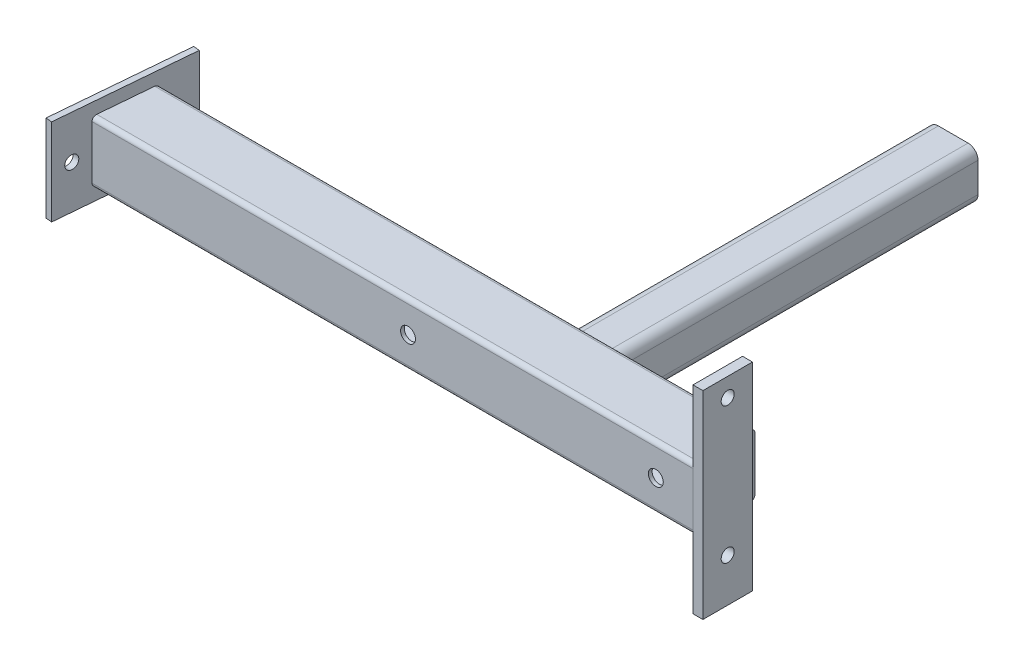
ISO-10303-21;
HEADER;
FILE_DESCRIPTION(('STEP AP214'),'2;1');
FILE_NAME('part.step','',(''),(''),'','','');
FILE_SCHEMA(('AUTOMOTIVE_DESIGN { 1 0 10303 214 1 1 1 1 }'));
ENDSEC;
DATA;
#1=APPLICATION_CONTEXT('core data for automotive mechanical design processes');
#2=APPLICATION_PROTOCOL_DEFINITION('international standard','automotive_design',2000,#1);
#3=PRODUCT_CONTEXT('',#1,'mechanical');
#4=PRODUCT('Part','Part','',(#3));
#5=PRODUCT_RELATED_PRODUCT_CATEGORY('part','',(#4));
#6=PRODUCT_DEFINITION_FORMATION('','',#4);
#7=PRODUCT_DEFINITION_CONTEXT('part definition',#1,'design');
#8=PRODUCT_DEFINITION('design','',#6,#7);
#9=PRODUCT_DEFINITION_SHAPE('','',#8);
#10=(LENGTH_UNIT() NAMED_UNIT(*) SI_UNIT(.MILLI.,.METRE.));
#11=(NAMED_UNIT(*) PLANE_ANGLE_UNIT() SI_UNIT($,.RADIAN.));
#12=(NAMED_UNIT(*) SI_UNIT($,.STERADIAN.) SOLID_ANGLE_UNIT());
#13=UNCERTAINTY_MEASURE_WITH_UNIT(LENGTH_MEASURE(1.E-05),#10,'distance_accuracy_value','');
#14=(GEOMETRIC_REPRESENTATION_CONTEXT(3) GLOBAL_UNCERTAINTY_ASSIGNED_CONTEXT((#13)) GLOBAL_UNIT_ASSIGNED_CONTEXT((#10,
#11,#12)) REPRESENTATION_CONTEXT('',''));
#15=CARTESIAN_POINT('',(0.,0.,0.));
#16=DIRECTION('',(0.,0.,1.));
#17=DIRECTION('',(1.,0.,0.));
#18=AXIS2_PLACEMENT_3D('',#15,#16,#17);
#19=CARTESIAN_POINT('',(-362.603937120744,-35.,54.5448327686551));
#20=DIRECTION('',(0.996194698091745,0.,0.0871557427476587));
#21=DIRECTION('',(0.0871557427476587,0.,-0.996194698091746));
#22=AXIS2_PLACEMENT_3D('',#19,#20,#21);
#23=PLANE('',#22);
#24=CARTESIAN_POINT('',(-354.324141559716,0.,-40.0936635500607));
#25=DIRECTION('',(-0.996194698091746,0.,-0.0871557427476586));
#26=DIRECTION('',(-0.0871557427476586,0.,0.996194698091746));
#27=AXIS2_PLACEMENT_3D('',#24,#25,#26);
#28=CIRCLE('',#27,5.25);
#29=CARTESIAN_POINT('',(-354.781709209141,0.,-34.8636413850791));
#30=VERTEX_POINT('',#29);
#31=EDGE_CURVE('E160',#30,#30,#28,.T.);
#32=ORIENTED_EDGE('',*,*,#31,.F.);
#33=EDGE_LOOP('',(#32));
#34=FACE_BOUND('',#33,.T.);
#35=DIRECTION('',(0.,1.,0.));
#36=VECTOR('',#35,1.);
#37=CARTESIAN_POINT('',(-362.603937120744,35.,54.5448327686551));
#38=LINE('',#37,#36);
#39=CARTESIAN_POINT('',(-362.603937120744,-35.,54.5448327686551));
#40=VERTEX_POINT('',#39);
#41=CARTESIAN_POINT('',(-362.603937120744,35.,54.5448327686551));
#42=VERTEX_POINT('',#41);
#43=EDGE_CURVE('E145',#40,#42,#38,.T.);
#44=ORIENTED_EDGE('',*,*,#43,.T.);
#45=DIRECTION('',(0.0871557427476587,0.,-0.996194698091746));
#46=VECTOR('',#45,1.);
#47=CARTESIAN_POINT('',(-362.603937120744,35.,54.5448327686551));
#48=LINE('',#47,#46);
#49=CARTESIAN_POINT('',(-353.016805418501,35.,-55.0365840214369));
#50=VERTEX_POINT('',#49);
#51=EDGE_CURVE('E140',#42,#50,#48,.T.);
#52=ORIENTED_EDGE('',*,*,#51,.T.);
#53=DIRECTION('',(0.,-1.,0.));
#54=VECTOR('',#53,1.);
#55=CARTESIAN_POINT('',(-353.016805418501,35.,-55.0365840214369));
#56=LINE('',#55,#54);
#57=CARTESIAN_POINT('',(-353.016805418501,-35.,-55.0365840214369));
#58=VERTEX_POINT('',#57);
#59=EDGE_CURVE('E143',#50,#58,#56,.T.);
#60=ORIENTED_EDGE('',*,*,#59,.T.);
#61=DIRECTION('',(-0.0871557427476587,0.,0.996194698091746));
#62=VECTOR('',#61,1.);
#63=CARTESIAN_POINT('',(-362.603937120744,-35.,54.5448327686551));
#64=LINE('',#63,#62);
#65=EDGE_CURVE('E110',#58,#40,#64,.T.);
#66=ORIENTED_EDGE('',*,*,#65,.T.);
#67=EDGE_LOOP('',(#44,#52,#60,#66));
#68=FACE_BOUND('',#67,.T.);
#69=CARTESIAN_POINT('',(-361.296600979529,0.,39.6019122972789));
#70=DIRECTION('',(-0.996194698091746,0.,-0.0871557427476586));
#71=DIRECTION('',(-0.0871557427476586,0.,0.996194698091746));
#72=AXIS2_PLACEMENT_3D('',#69,#70,#71);
#73=CIRCLE('',#72,5.24999999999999);
#74=CARTESIAN_POINT('',(-361.754168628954,0.,44.8319344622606));
#75=VERTEX_POINT('',#74);
#76=EDGE_CURVE('E175',#75,#75,#73,.T.);
#77=ORIENTED_EDGE('',*,*,#76,.F.);
#78=EDGE_LOOP('',(#77));
#79=FACE_BOUND('',#78,.T.);
#80=ADVANCED_FACE('F93',(#34,#68,#79),#23,.F.);
#81=CARTESIAN_POINT('',(-357.622963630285,-35.,54.9806114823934));
#82=DIRECTION('',(0.996194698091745,0.,0.0871557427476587));
#83=DIRECTION('',(0.0871557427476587,0.,-0.996194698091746));
#84=AXIS2_PLACEMENT_3D('',#81,#82,#83);
#85=PLANE('',#84);
#86=CARTESIAN_POINT('',(-349.343168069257,0.,-39.6578848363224));
#87=DIRECTION('',(-0.996194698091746,0.,-0.0871557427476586));
#88=DIRECTION('',(-0.0871557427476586,0.,0.996194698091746));
#89=AXIS2_PLACEMENT_3D('',#86,#87,#88);
#90=CIRCLE('',#89,5.25);
#91=CARTESIAN_POINT('',(-349.800735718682,0.,-34.4278626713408));
#92=VERTEX_POINT('',#91);
#93=EDGE_CURVE('E172',#92,#92,#90,.T.);
#94=ORIENTED_EDGE('',*,*,#93,.T.);
#95=EDGE_LOOP('',(#94));
#96=FACE_BOUND('',#95,.T.);
#97=DIRECTION('',(0.,1.,0.));
#98=VECTOR('',#97,1.);
#99=CARTESIAN_POINT('',(-357.622963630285,35.,54.9806114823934));
#100=LINE('',#99,#98);
#101=CARTESIAN_POINT('',(-357.622963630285,-35.,54.9806114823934));
#102=VERTEX_POINT('',#101);
#103=CARTESIAN_POINT('',(-357.622963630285,35.,54.9806114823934));
#104=VERTEX_POINT('',#103);
#105=EDGE_CURVE('E157',#102,#104,#100,.T.);
#106=ORIENTED_EDGE('',*,*,#105,.F.);
#107=DIRECTION('',(-0.0871557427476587,0.,0.996194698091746));
#108=VECTOR('',#107,1.);
#109=CARTESIAN_POINT('',(-357.622963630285,-35.,54.9806114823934));
#110=LINE('',#109,#108);
#111=CARTESIAN_POINT('',(-348.035831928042,-35.,-54.6008053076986));
#112=VERTEX_POINT('',#111);
#113=EDGE_CURVE('E133',#112,#102,#110,.T.);
#114=ORIENTED_EDGE('',*,*,#113,.F.);
#115=DIRECTION('',(0.,-1.,0.));
#116=VECTOR('',#115,1.);
#117=CARTESIAN_POINT('',(-348.035831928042,35.,-54.6008053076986));
#118=LINE('',#117,#116);
#119=CARTESIAN_POINT('',(-348.035831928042,35.,-54.6008053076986));
#120=VERTEX_POINT('',#119);
#121=EDGE_CURVE('E127',#120,#112,#118,.T.);
#122=ORIENTED_EDGE('',*,*,#121,.F.);
#123=DIRECTION('',(0.0871557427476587,0.,-0.996194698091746));
#124=VECTOR('',#123,1.);
#125=CARTESIAN_POINT('',(-357.622963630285,35.,54.9806114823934));
#126=LINE('',#125,#124);
#127=EDGE_CURVE('E149',#104,#120,#126,.T.);
#128=ORIENTED_EDGE('',*,*,#127,.F.);
#129=EDGE_LOOP('',(#106,#114,#122,#128));
#130=FACE_BOUND('',#129,.T.);
#131=CARTESIAN_POINT('',(-356.31562748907,0.,40.0376910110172));
#132=DIRECTION('',(-0.996194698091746,0.,-0.0871557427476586));
#133=DIRECTION('',(-0.0871557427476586,0.,0.996194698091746));
#134=AXIS2_PLACEMENT_3D('',#131,#132,#133);
#135=CIRCLE('',#134,5.24999999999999);
#136=CARTESIAN_POINT('',(-356.773195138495,0.,45.2677131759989));
#137=VERTEX_POINT('',#136);
#138=EDGE_CURVE('E178',#137,#137,#135,.T.);
#139=ORIENTED_EDGE('',*,*,#138,.T.);
#140=EDGE_LOOP('',(#139));
#141=FACE_BOUND('',#140,.T.);
#142=ADVANCED_FACE('F168',(#96,#130,#141),#85,.T.);
#143=CARTESIAN_POINT('',(-362.603937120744,35.,54.5448327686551));
#144=DIRECTION('',(0.0871557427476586,0.,-0.996194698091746));
#145=DIRECTION('',(-0.996194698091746,0.,-0.0871557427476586));
#146=AXIS2_PLACEMENT_3D('',#143,#144,#145);
#147=PLANE('',#146);
#148=ORIENTED_EDGE('',*,*,#105,.T.);
#149=DIRECTION('',(0.996194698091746,0.,0.0871557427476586));
#150=VECTOR('',#149,1.);
#151=CARTESIAN_POINT('',(-362.603937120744,35.,54.5448327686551));
#152=LINE('',#151,#150);
#153=EDGE_CURVE('E13',#42,#104,#152,.T.);
#154=ORIENTED_EDGE('',*,*,#153,.F.);
#155=ORIENTED_EDGE('',*,*,#43,.F.);
#156=DIRECTION('',(0.996194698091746,0.,0.0871557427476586));
#157=VECTOR('',#156,1.);
#158=CARTESIAN_POINT('',(-362.603937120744,-35.,54.5448327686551));
#159=LINE('',#158,#157);
#160=EDGE_CURVE('E153',#40,#102,#159,.T.);
#161=ORIENTED_EDGE('',*,*,#160,.T.);
#162=EDGE_LOOP('',(#148,#154,#155,#161));
#163=FACE_BOUND('',#162,.T.);
#164=ADVANCED_FACE('F95',(#163),#147,.F.);
#165=CARTESIAN_POINT('',(-362.603937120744,35.,54.5448327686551));
#166=DIRECTION('',(0.,-1.,0.));
#167=DIRECTION('',(0.,0.,-1.));
#168=AXIS2_PLACEMENT_3D('',#165,#166,#167);
#169=PLANE('',#168);
#170=ORIENTED_EDGE('',*,*,#127,.T.);
#171=DIRECTION('',(0.996194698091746,0.,0.0871557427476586));
#172=VECTOR('',#171,1.);
#173=CARTESIAN_POINT('',(-353.016805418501,35.,-55.0365840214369));
#174=LINE('',#173,#172);
#175=EDGE_CURVE('E102',#50,#120,#174,.T.);
#176=ORIENTED_EDGE('',*,*,#175,.F.);
#177=ORIENTED_EDGE('',*,*,#51,.F.);
#178=ORIENTED_EDGE('',*,*,#153,.T.);
#179=EDGE_LOOP('',(#170,#176,#177,#178));
#180=FACE_BOUND('',#179,.T.);
#181=ADVANCED_FACE('F148',(#180),#169,.F.);
#182=CARTESIAN_POINT('',(-353.016805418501,35.,-55.0365840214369));
#183=DIRECTION('',(-0.0871557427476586,0.,0.996194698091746));
#184=DIRECTION('',(0.996194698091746,0.,0.0871557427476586));
#185=AXIS2_PLACEMENT_3D('',#182,#183,#184);
#186=PLANE('',#185);
#187=ORIENTED_EDGE('',*,*,#121,.T.);
#188=DIRECTION('',(0.996194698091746,0.,0.0871557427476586));
#189=VECTOR('',#188,1.);
#190=CARTESIAN_POINT('',(-353.016805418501,-35.,-55.0365840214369));
#191=LINE('',#190,#189);
#192=EDGE_CURVE('E150',#58,#112,#191,.T.);
#193=ORIENTED_EDGE('',*,*,#192,.F.);
#194=ORIENTED_EDGE('',*,*,#59,.F.);
#195=ORIENTED_EDGE('',*,*,#175,.T.);
#196=EDGE_LOOP('',(#187,#193,#194,#195));
#197=FACE_BOUND('',#196,.T.);
#198=ADVANCED_FACE('F151',(#197),#186,.F.);
#199=CARTESIAN_POINT('',(-362.603937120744,-35.,54.5448327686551));
#200=DIRECTION('',(0.,1.,0.));
#201=DIRECTION('',(0.,0.,1.));
#202=AXIS2_PLACEMENT_3D('',#199,#200,#201);
#203=PLANE('',#202);
#204=ORIENTED_EDGE('',*,*,#113,.T.);
#205=ORIENTED_EDGE('',*,*,#160,.F.);
#206=ORIENTED_EDGE('',*,*,#65,.F.);
#207=ORIENTED_EDGE('',*,*,#192,.T.);
#208=EDGE_LOOP('',(#204,#205,#206,#207));
#209=FACE_BOUND('',#208,.T.);
#210=ADVANCED_FACE('F165',(#209),#203,.F.);
#211=CARTESIAN_POINT('',(-354.324141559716,0.,-40.0936635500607));
#212=DIRECTION('',(0.996194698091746,0.,0.0871557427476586));
#213=DIRECTION('',(0.0871557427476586,0.,-0.996194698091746));
#214=AXIS2_PLACEMENT_3D('',#211,#212,#213);
#215=CYLINDRICAL_SURFACE('',#214,5.25);
#216=ORIENTED_EDGE('',*,*,#31,.T.);
#217=EDGE_LOOP('',(#216));
#218=FACE_BOUND('',#217,.T.);
#219=ORIENTED_EDGE('',*,*,#93,.F.);
#220=EDGE_LOOP('',(#219));
#221=FACE_BOUND('',#220,.T.);
#222=ADVANCED_FACE('F196',(#218,#221),#215,.F.);
#223=CARTESIAN_POINT('',(-361.296600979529,0.,39.6019122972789));
#224=DIRECTION('',(0.996194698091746,0.,0.0871557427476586));
#225=DIRECTION('',(0.0871557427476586,0.,-0.996194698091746));
#226=AXIS2_PLACEMENT_3D('',#223,#224,#225);
#227=CYLINDRICAL_SURFACE('',#226,5.24999999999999);
#228=ORIENTED_EDGE('',*,*,#76,.T.);
#229=EDGE_LOOP('',(#228));
#230=FACE_BOUND('',#229,.T.);
#231=ORIENTED_EDGE('',*,*,#138,.F.);
#232=EDGE_LOOP('',(#231));
#233=FACE_BOUND('',#232,.T.);
#234=ADVANCED_FACE('F184',(#230,#233),#227,.F.);
#235=CLOSED_SHELL('',(#80,#142,#164,#181,#198,#210,#222,#234));
#236=MANIFOLD_SOLID_BREP('B2',#235);
#237=CARTESIAN_POINT('',(138.,-80.,25.));
#238=DIRECTION('',(1.,0.,0.));
#239=DIRECTION('',(0.,0.,-1.));
#240=AXIS2_PLACEMENT_3D('',#237,#238,#239);
#241=PLANE('',#240);
#242=CARTESIAN_POINT('',(138.,65.,5.00000000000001));
#243=DIRECTION('',(1.,0.,0.));
#244=DIRECTION('',(0.,0.,-1.));
#245=AXIS2_PLACEMENT_3D('',#242,#243,#244);
#246=CIRCLE('',#245,5.25);
#247=CARTESIAN_POINT('',(138.,65.,-0.249999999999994));
#248=VERTEX_POINT('',#247);
#249=EDGE_CURVE('E335',#248,#248,#246,.T.);
#250=ORIENTED_EDGE('',*,*,#249,.F.);
#251=EDGE_LOOP('',(#250));
#252=FACE_BOUND('',#251,.T.);
#253=DIRECTION('',(0.,-1.,0.));
#254=VECTOR('',#253,1.);
#255=CARTESIAN_POINT('',(138.,80.,25.));
#256=LINE('',#255,#254);
#257=CARTESIAN_POINT('',(138.,80.,25.));
#258=VERTEX_POINT('',#257);
#259=CARTESIAN_POINT('',(138.,-80.,25.));
#260=VERTEX_POINT('',#259);
#261=EDGE_CURVE('E320',#258,#260,#256,.T.);
#262=ORIENTED_EDGE('',*,*,#261,.T.);
#263=DIRECTION('',(0.,0.,-1.));
#264=VECTOR('',#263,1.);
#265=CARTESIAN_POINT('',(138.,-80.,25.));
#266=LINE('',#265,#264);
#267=CARTESIAN_POINT('',(138.,-80.,-15.));
#268=VERTEX_POINT('',#267);
#269=EDGE_CURVE('E315',#260,#268,#266,.T.);
#270=ORIENTED_EDGE('',*,*,#269,.T.);
#271=DIRECTION('',(0.,1.,0.));
#272=VECTOR('',#271,1.);
#273=CARTESIAN_POINT('',(138.,80.,-15.));
#274=LINE('',#273,#272);
#275=CARTESIAN_POINT('',(138.,80.,-15.));
#276=VERTEX_POINT('',#275);
#277=EDGE_CURVE('E318',#268,#276,#274,.T.);
#278=ORIENTED_EDGE('',*,*,#277,.T.);
#279=DIRECTION('',(0.,0.,1.));
#280=VECTOR('',#279,1.);
#281=CARTESIAN_POINT('',(138.,80.,25.));
#282=LINE('',#281,#280);
#283=EDGE_CURVE('E285',#276,#258,#282,.T.);
#284=ORIENTED_EDGE('',*,*,#283,.T.);
#285=EDGE_LOOP('',(#262,#270,#278,#284));
#286=FACE_BOUND('',#285,.T.);
#287=CARTESIAN_POINT('',(138.,-45.,5.00000000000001));
#288=DIRECTION('',(1.,0.,0.));
#289=DIRECTION('',(0.,0.,-1.));
#290=AXIS2_PLACEMENT_3D('',#287,#288,#289);
#291=CIRCLE('',#290,5.25);
#292=CARTESIAN_POINT('',(138.,-45.,-0.249999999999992));
#293=VERTEX_POINT('',#292);
#294=EDGE_CURVE('E350',#293,#293,#291,.T.);
#295=ORIENTED_EDGE('',*,*,#294,.F.);
#296=EDGE_LOOP('',(#295));
#297=FACE_BOUND('',#296,.T.);
#298=ADVANCED_FACE('F268',(#252,#286,#297),#241,.T.);
#299=CARTESIAN_POINT('',(130.,-80.,25.));
#300=DIRECTION('',(1.,0.,0.));
#301=DIRECTION('',(0.,0.,-1.));
#302=AXIS2_PLACEMENT_3D('',#299,#300,#301);
#303=PLANE('',#302);
#304=CARTESIAN_POINT('',(130.,65.,5.00000000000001));
#305=DIRECTION('',(1.,0.,0.));
#306=DIRECTION('',(0.,0.,-1.));
#307=AXIS2_PLACEMENT_3D('',#304,#305,#306);
#308=CIRCLE('',#307,5.25);
#309=CARTESIAN_POINT('',(130.,65.,-0.249999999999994));
#310=VERTEX_POINT('',#309);
#311=EDGE_CURVE('E347',#310,#310,#308,.T.);
#312=ORIENTED_EDGE('',*,*,#311,.T.);
#313=EDGE_LOOP('',(#312));
#314=FACE_BOUND('',#313,.T.);
#315=DIRECTION('',(0.,-1.,0.));
#316=VECTOR('',#315,1.);
#317=CARTESIAN_POINT('',(130.,80.,25.));
#318=LINE('',#317,#316);
#319=CARTESIAN_POINT('',(130.,80.,25.));
#320=VERTEX_POINT('',#319);
#321=CARTESIAN_POINT('',(130.,-80.,25.));
#322=VERTEX_POINT('',#321);
#323=EDGE_CURVE('E332',#320,#322,#318,.T.);
#324=ORIENTED_EDGE('',*,*,#323,.F.);
#325=DIRECTION('',(0.,0.,1.));
#326=VECTOR('',#325,1.);
#327=CARTESIAN_POINT('',(130.,80.,25.));
#328=LINE('',#327,#326);
#329=CARTESIAN_POINT('',(130.,80.,-15.));
#330=VERTEX_POINT('',#329);
#331=EDGE_CURVE('E308',#330,#320,#328,.T.);
#332=ORIENTED_EDGE('',*,*,#331,.F.);
#333=DIRECTION('',(0.,1.,0.));
#334=VECTOR('',#333,1.);
#335=CARTESIAN_POINT('',(130.,80.,-15.));
#336=LINE('',#335,#334);
#337=CARTESIAN_POINT('',(130.,-80.,-15.));
#338=VERTEX_POINT('',#337);
#339=EDGE_CURVE('E302',#338,#330,#336,.T.);
#340=ORIENTED_EDGE('',*,*,#339,.F.);
#341=DIRECTION('',(0.,0.,-1.));
#342=VECTOR('',#341,1.);
#343=CARTESIAN_POINT('',(130.,-80.,25.));
#344=LINE('',#343,#342);
#345=EDGE_CURVE('E324',#322,#338,#344,.T.);
#346=ORIENTED_EDGE('',*,*,#345,.F.);
#347=EDGE_LOOP('',(#324,#332,#340,#346));
#348=FACE_BOUND('',#347,.T.);
#349=CARTESIAN_POINT('',(130.,-45.,5.00000000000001));
#350=DIRECTION('',(1.,0.,0.));
#351=DIRECTION('',(0.,0.,-1.));
#352=AXIS2_PLACEMENT_3D('',#349,#350,#351);
#353=CIRCLE('',#352,5.25);
#354=CARTESIAN_POINT('',(130.,-45.,-0.249999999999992));
#355=VERTEX_POINT('',#354);
#356=EDGE_CURVE('E353',#355,#355,#353,.T.);
#357=ORIENTED_EDGE('',*,*,#356,.T.);
#358=EDGE_LOOP('',(#357));
#359=FACE_BOUND('',#358,.T.);
#360=ADVANCED_FACE('F343',(#314,#348,#359),#303,.F.);
#361=CARTESIAN_POINT('',(138.,80.,25.));
#362=DIRECTION('',(0.,0.,-1.));
#363=DIRECTION('',(0.,1.,0.));
#364=AXIS2_PLACEMENT_3D('',#361,#362,#363);
#365=PLANE('',#364);
#366=ORIENTED_EDGE('',*,*,#323,.T.);
#367=DIRECTION('',(-1.,0.,0.));
#368=VECTOR('',#367,1.);
#369=CARTESIAN_POINT('',(138.,-80.,25.));
#370=LINE('',#369,#368);
#371=EDGE_CURVE('E91',#260,#322,#370,.T.);
#372=ORIENTED_EDGE('',*,*,#371,.F.);
#373=ORIENTED_EDGE('',*,*,#261,.F.);
#374=DIRECTION('',(-1.,0.,0.));
#375=VECTOR('',#374,1.);
#376=CARTESIAN_POINT('',(138.,80.,25.));
#377=LINE('',#376,#375);
#378=EDGE_CURVE('E328',#258,#320,#377,.T.);
#379=ORIENTED_EDGE('',*,*,#378,.T.);
#380=EDGE_LOOP('',(#366,#372,#373,#379));
#381=FACE_BOUND('',#380,.T.);
#382=ADVANCED_FACE('F270',(#381),#365,.F.);
#383=CARTESIAN_POINT('',(138.,-80.,25.));
#384=DIRECTION('',(0.,1.,0.));
#385=DIRECTION('',(0.,0.,1.));
#386=AXIS2_PLACEMENT_3D('',#383,#384,#385);
#387=PLANE('',#386);
#388=ORIENTED_EDGE('',*,*,#345,.T.);
#389=DIRECTION('',(-1.,0.,0.));
#390=VECTOR('',#389,1.);
#391=CARTESIAN_POINT('',(138.,-80.,-15.));
#392=LINE('',#391,#390);
#393=EDGE_CURVE('E277',#268,#338,#392,.T.);
#394=ORIENTED_EDGE('',*,*,#393,.F.);
#395=ORIENTED_EDGE('',*,*,#269,.F.);
#396=ORIENTED_EDGE('',*,*,#371,.T.);
#397=EDGE_LOOP('',(#388,#394,#395,#396));
#398=FACE_BOUND('',#397,.T.);
#399=ADVANCED_FACE('F323',(#398),#387,.F.);
#400=CARTESIAN_POINT('',(138.,80.,-15.));
#401=DIRECTION('',(0.,0.,1.));
#402=DIRECTION('',(0.,-1.,0.));
#403=AXIS2_PLACEMENT_3D('',#400,#401,#402);
#404=PLANE('',#403);
#405=ORIENTED_EDGE('',*,*,#339,.T.);
#406=DIRECTION('',(-1.,0.,0.));
#407=VECTOR('',#406,1.);
#408=CARTESIAN_POINT('',(138.,80.,-15.));
#409=LINE('',#408,#407);
#410=EDGE_CURVE('E325',#276,#330,#409,.T.);
#411=ORIENTED_EDGE('',*,*,#410,.F.);
#412=ORIENTED_EDGE('',*,*,#277,.F.);
#413=ORIENTED_EDGE('',*,*,#393,.T.);
#414=EDGE_LOOP('',(#405,#411,#412,#413));
#415=FACE_BOUND('',#414,.T.);
#416=ADVANCED_FACE('F326',(#415),#404,.F.);
#417=CARTESIAN_POINT('',(138.,80.,25.));
#418=DIRECTION('',(0.,-1.,0.));
#419=DIRECTION('',(0.,0.,-1.));
#420=AXIS2_PLACEMENT_3D('',#417,#418,#419);
#421=PLANE('',#420);
#422=ORIENTED_EDGE('',*,*,#331,.T.);
#423=ORIENTED_EDGE('',*,*,#378,.F.);
#424=ORIENTED_EDGE('',*,*,#283,.F.);
#425=ORIENTED_EDGE('',*,*,#410,.T.);
#426=EDGE_LOOP('',(#422,#423,#424,#425));
#427=FACE_BOUND('',#426,.T.);
#428=ADVANCED_FACE('F340',(#427),#421,.F.);
#429=CARTESIAN_POINT('',(138.,65.,5.00000000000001));
#430=DIRECTION('',(-1.,0.,0.));
#431=DIRECTION('',(0.,0.,1.));
#432=AXIS2_PLACEMENT_3D('',#429,#430,#431);
#433=CYLINDRICAL_SURFACE('',#432,5.25);
#434=ORIENTED_EDGE('',*,*,#249,.T.);
#435=EDGE_LOOP('',(#434));
#436=FACE_BOUND('',#435,.T.);
#437=ORIENTED_EDGE('',*,*,#311,.F.);
#438=EDGE_LOOP('',(#437));
#439=FACE_BOUND('',#438,.T.);
#440=ADVANCED_FACE('F371',(#436,#439),#433,.F.);
#441=CARTESIAN_POINT('',(138.,-45.,5.00000000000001));
#442=DIRECTION('',(-1.,0.,0.));
#443=DIRECTION('',(0.,0.,1.));
#444=AXIS2_PLACEMENT_3D('',#441,#442,#443);
#445=CYLINDRICAL_SURFACE('',#444,5.25);
#446=ORIENTED_EDGE('',*,*,#294,.T.);
#447=EDGE_LOOP('',(#446));
#448=FACE_BOUND('',#447,.T.);
#449=ORIENTED_EDGE('',*,*,#356,.F.);
#450=EDGE_LOOP('',(#449));
#451=FACE_BOUND('',#450,.T.);
#452=ADVANCED_FACE('F359',(#448,#451),#445,.F.);
#453=CLOSED_SHELL('',(#298,#360,#382,#399,#416,#428,#440,#452));
#454=MANIFOLD_SOLID_BREP('B7',#453);
#455=CARTESIAN_POINT('',(12.,-12.,-315.));
#456=DIRECTION('',(0.,0.,1.));
#457=DIRECTION('',(0.,-1.,0.));
#458=AXIS2_PLACEMENT_3D('',#455,#456,#457);
#459=CYLINDRICAL_SURFACE('',#458,8.);
#460=CARTESIAN_POINT('',(12.,-12.,-25.));
#461=DIRECTION('',(0.,0.,-1.));
#462=DIRECTION('',(-1.,0.,0.));
#463=AXIS2_PLACEMENT_3D('',#460,#461,#462);
#464=CIRCLE('',#463,8.);
#465=CARTESIAN_POINT('',(20.,-12.,-25.));
#466=VERTEX_POINT('',#465);
#467=CARTESIAN_POINT('',(12.,-20.,-25.));
#468=VERTEX_POINT('',#467);
#469=EDGE_CURVE('E614',#466,#468,#464,.T.);
#470=ORIENTED_EDGE('',*,*,#469,.T.);
#471=DIRECTION('',(0.,0.,1.));
#472=VECTOR('',#471,1.);
#473=CARTESIAN_POINT('',(12.,-20.,-315.));
#474=LINE('',#473,#472);
#475=CARTESIAN_POINT('',(12.,-20.,-315.));
#476=VERTEX_POINT('',#475);
#477=EDGE_CURVE('E266',#476,#468,#474,.T.);
#478=ORIENTED_EDGE('',*,*,#477,.F.);
#479=CARTESIAN_POINT('',(12.,-12.,-315.));
#480=DIRECTION('',(0.,0.,-1.));
#481=DIRECTION('',(-1.,0.,0.));
#482=AXIS2_PLACEMENT_3D('',#479,#480,#481);
#483=CIRCLE('',#482,8.);
#484=CARTESIAN_POINT('',(20.,-12.,-315.));
#485=VERTEX_POINT('',#484);
#486=EDGE_CURVE('E692',#485,#476,#483,.T.);
#487=ORIENTED_EDGE('',*,*,#486,.F.);
#488=DIRECTION('',(0.,0.,1.));
#489=VECTOR('',#488,1.);
#490=CARTESIAN_POINT('',(20.,-12.,-315.));
#491=LINE('',#490,#489);
#492=EDGE_CURVE('E629',#485,#466,#491,.T.);
#493=ORIENTED_EDGE('',*,*,#492,.T.);
#494=EDGE_LOOP('',(#470,#478,#487,#493));
#495=FACE_BOUND('',#494,.T.);
#496=ADVANCED_FACE('F442',(#495),#459,.T.);
#497=CARTESIAN_POINT('',(12.,-20.,-315.));
#498=DIRECTION('',(0.,1.,0.));
#499=DIRECTION('',(0.,0.,1.));
#500=AXIS2_PLACEMENT_3D('',#497,#498,#499);
#501=PLANE('',#500);
#502=DIRECTION('',(-1.,0.,0.));
#503=VECTOR('',#502,1.);
#504=CARTESIAN_POINT('',(12.,-20.,-25.));
#505=LINE('',#504,#503);
#506=CARTESIAN_POINT('',(-12.,-20.,-25.));
#507=VERTEX_POINT('',#506);
#508=EDGE_CURVE('E617',#468,#507,#505,.T.);
#509=ORIENTED_EDGE('',*,*,#508,.T.);
#510=DIRECTION('',(0.,0.,1.));
#511=VECTOR('',#510,1.);
#512=CARTESIAN_POINT('',(-12.,-20.,-315.));
#513=LINE('',#512,#511);
#514=CARTESIAN_POINT('',(-12.,-20.,-315.));
#515=VERTEX_POINT('',#514);
#516=EDGE_CURVE('E452',#515,#507,#513,.T.);
#517=ORIENTED_EDGE('',*,*,#516,.F.);
#518=DIRECTION('',(-1.,0.,0.));
#519=VECTOR('',#518,1.);
#520=CARTESIAN_POINT('',(12.,-20.,-315.));
#521=LINE('',#520,#519);
#522=EDGE_CURVE('E694',#476,#515,#521,.T.);
#523=ORIENTED_EDGE('',*,*,#522,.F.);
#524=ORIENTED_EDGE('',*,*,#477,.T.);
#525=EDGE_LOOP('',(#509,#517,#523,#524));
#526=FACE_BOUND('',#525,.T.);
#527=ADVANCED_FACE('F729',(#526),#501,.F.);
#528=CARTESIAN_POINT('',(-12.,-12.,-315.));
#529=DIRECTION('',(0.,0.,1.));
#530=DIRECTION('',(0.,-1.,0.));
#531=AXIS2_PLACEMENT_3D('',#528,#529,#530);
#532=CYLINDRICAL_SURFACE('',#531,8.);
#533=CARTESIAN_POINT('',(-12.,-12.,-25.));
#534=DIRECTION('',(0.,0.,-1.));
#535=DIRECTION('',(-1.,0.,0.));
#536=AXIS2_PLACEMENT_3D('',#533,#534,#535);
#537=CIRCLE('',#536,8.);
#538=CARTESIAN_POINT('',(-20.,-12.,-25.));
#539=VERTEX_POINT('',#538);
#540=EDGE_CURVE('E619',#507,#539,#537,.T.);
#541=ORIENTED_EDGE('',*,*,#540,.T.);
#542=DIRECTION('',(0.,0.,1.));
#543=VECTOR('',#542,1.);
#544=CARTESIAN_POINT('',(-20.,-12.,-315.));
#545=LINE('',#544,#543);
#546=CARTESIAN_POINT('',(-20.,-12.,-315.));
#547=VERTEX_POINT('',#546);
#548=EDGE_CURVE('E636',#547,#539,#545,.T.);
#549=ORIENTED_EDGE('',*,*,#548,.F.);
#550=CARTESIAN_POINT('',(-12.,-12.,-315.));
#551=DIRECTION('',(0.,0.,-1.));
#552=DIRECTION('',(-1.,0.,0.));
#553=AXIS2_PLACEMENT_3D('',#550,#551,#552);
#554=CIRCLE('',#553,8.);
#555=EDGE_CURVE('E696',#515,#547,#554,.T.);
#556=ORIENTED_EDGE('',*,*,#555,.F.);
#557=ORIENTED_EDGE('',*,*,#516,.T.);
#558=EDGE_LOOP('',(#541,#549,#556,#557));
#559=FACE_BOUND('',#558,.T.);
#560=ADVANCED_FACE('F734',(#559),#532,.T.);
#561=CARTESIAN_POINT('',(-20.,12.,-315.));
#562=DIRECTION('',(1.,0.,0.));
#563=DIRECTION('',(0.,0.,-1.));
#564=AXIS2_PLACEMENT_3D('',#561,#562,#563);
#565=PLANE('',#564);
#566=DIRECTION('',(0.,1.,0.));
#567=VECTOR('',#566,1.);
#568=CARTESIAN_POINT('',(-20.,12.,-25.));
#569=LINE('',#568,#567);
#570=CARTESIAN_POINT('',(-20.,12.,-25.));
#571=VERTEX_POINT('',#570);
#572=EDGE_CURVE('E621',#539,#571,#569,.T.);
#573=ORIENTED_EDGE('',*,*,#572,.T.);
#574=DIRECTION('',(0.,0.,1.));
#575=VECTOR('',#574,1.);
#576=CARTESIAN_POINT('',(-20.,12.,-315.));
#577=LINE('',#576,#575);
#578=CARTESIAN_POINT('',(-20.,12.,-315.));
#579=VERTEX_POINT('',#578);
#580=EDGE_CURVE('E633',#579,#571,#577,.T.);
#581=ORIENTED_EDGE('',*,*,#580,.F.);
#582=DIRECTION('',(0.,1.,0.));
#583=VECTOR('',#582,1.);
#584=CARTESIAN_POINT('',(-20.,12.,-315.));
#585=LINE('',#584,#583);
#586=EDGE_CURVE('E698',#547,#579,#585,.T.);
#587=ORIENTED_EDGE('',*,*,#586,.F.);
#588=ORIENTED_EDGE('',*,*,#548,.T.);
#589=EDGE_LOOP('',(#573,#581,#587,#588));
#590=FACE_BOUND('',#589,.T.);
#591=ADVANCED_FACE('F704',(#590),#565,.F.);
#592=CARTESIAN_POINT('',(-12.,12.,-315.));
#593=DIRECTION('',(0.,0.,1.));
#594=DIRECTION('',(0.,-1.,0.));
#595=AXIS2_PLACEMENT_3D('',#592,#593,#594);
#596=CYLINDRICAL_SURFACE('',#595,8.);
#597=CARTESIAN_POINT('',(-12.,12.,-25.));
#598=DIRECTION('',(0.,0.,-1.));
#599=DIRECTION('',(-1.,0.,0.));
#600=AXIS2_PLACEMENT_3D('',#597,#598,#599);
#601=CIRCLE('',#600,8.);
#602=CARTESIAN_POINT('',(-12.,20.,-25.));
#603=VERTEX_POINT('',#602);
#604=EDGE_CURVE('E623',#571,#603,#601,.T.);
#605=ORIENTED_EDGE('',*,*,#604,.T.);
#606=DIRECTION('',(0.,0.,1.));
#607=VECTOR('',#606,1.);
#608=CARTESIAN_POINT('',(-12.,20.,-315.));
#609=LINE('',#608,#607);
#610=CARTESIAN_POINT('',(-12.,20.,-315.));
#611=VERTEX_POINT('',#610);
#612=EDGE_CURVE('E581',#611,#603,#609,.T.);
#613=ORIENTED_EDGE('',*,*,#612,.F.);
#614=CARTESIAN_POINT('',(-12.,12.,-315.));
#615=DIRECTION('',(0.,0.,-1.));
#616=DIRECTION('',(-1.,0.,0.));
#617=AXIS2_PLACEMENT_3D('',#614,#615,#616);
#618=CIRCLE('',#617,8.);
#619=EDGE_CURVE('E572',#579,#611,#618,.T.);
#620=ORIENTED_EDGE('',*,*,#619,.F.);
#621=ORIENTED_EDGE('',*,*,#580,.T.);
#622=EDGE_LOOP('',(#605,#613,#620,#621));
#623=FACE_BOUND('',#622,.T.);
#624=ADVANCED_FACE('F708',(#623),#596,.T.);
#625=CARTESIAN_POINT('',(-12.,20.,-315.));
#626=DIRECTION('',(0.,-1.,0.));
#627=DIRECTION('',(0.,0.,-1.));
#628=AXIS2_PLACEMENT_3D('',#625,#626,#627);
#629=PLANE('',#628);
#630=DIRECTION('',(1.,0.,0.));
#631=VECTOR('',#630,1.);
#632=CARTESIAN_POINT('',(-12.,20.,-25.));
#633=LINE('',#632,#631);
#634=CARTESIAN_POINT('',(12.,20.,-25.));
#635=VERTEX_POINT('',#634);
#636=EDGE_CURVE('E580',#603,#635,#633,.T.);
#637=ORIENTED_EDGE('',*,*,#636,.T.);
#638=DIRECTION('',(0.,0.,1.));
#639=VECTOR('',#638,1.);
#640=CARTESIAN_POINT('',(12.,20.,-315.));
#641=LINE('',#640,#639);
#642=CARTESIAN_POINT('',(12.,20.,-315.));
#643=VERTEX_POINT('',#642);
#644=EDGE_CURVE('E577',#643,#635,#641,.T.);
#645=ORIENTED_EDGE('',*,*,#644,.F.);
#646=DIRECTION('',(1.,0.,0.));
#647=VECTOR('',#646,1.);
#648=CARTESIAN_POINT('',(-12.,20.,-315.));
#649=LINE('',#648,#647);
#650=EDGE_CURVE('E566',#611,#643,#649,.T.);
#651=ORIENTED_EDGE('',*,*,#650,.F.);
#652=ORIENTED_EDGE('',*,*,#612,.T.);
#653=EDGE_LOOP('',(#637,#645,#651,#652));
#654=FACE_BOUND('',#653,.T.);
#655=ADVANCED_FACE('F578',(#654),#629,.F.);
#656=CARTESIAN_POINT('',(12.,12.,-315.));
#657=DIRECTION('',(0.,0.,1.));
#658=DIRECTION('',(0.,-1.,0.));
#659=AXIS2_PLACEMENT_3D('',#656,#657,#658);
#660=CYLINDRICAL_SURFACE('',#659,8.);
#661=CARTESIAN_POINT('',(12.,12.,-25.));
#662=DIRECTION('',(0.,0.,-1.));
#663=DIRECTION('',(-1.,0.,0.));
#664=AXIS2_PLACEMENT_3D('',#661,#662,#663);
#665=CIRCLE('',#664,8.);
#666=CARTESIAN_POINT('',(20.,12.,-25.));
#667=VERTEX_POINT('',#666);
#668=EDGE_CURVE('E514',#635,#667,#665,.T.);
#669=ORIENTED_EDGE('',*,*,#668,.T.);
#670=DIRECTION('',(0.,0.,1.));
#671=VECTOR('',#670,1.);
#672=CARTESIAN_POINT('',(20.,12.,-315.));
#673=LINE('',#672,#671);
#674=CARTESIAN_POINT('',(20.,12.,-315.));
#675=VERTEX_POINT('',#674);
#676=EDGE_CURVE('E582',#675,#667,#673,.T.);
#677=ORIENTED_EDGE('',*,*,#676,.F.);
#678=CARTESIAN_POINT('',(12.,12.,-315.));
#679=DIRECTION('',(0.,0.,-1.));
#680=DIRECTION('',(-1.,0.,0.));
#681=AXIS2_PLACEMENT_3D('',#678,#679,#680);
#682=CIRCLE('',#681,8.);
#683=EDGE_CURVE('E570',#643,#675,#682,.T.);
#684=ORIENTED_EDGE('',*,*,#683,.F.);
#685=ORIENTED_EDGE('',*,*,#644,.T.);
#686=EDGE_LOOP('',(#669,#677,#684,#685));
#687=FACE_BOUND('',#686,.T.);
#688=ADVANCED_FACE('F584',(#687),#660,.T.);
#689=CARTESIAN_POINT('',(-12.,-12.,-315.));
#690=DIRECTION('',(0.,0.,1.));
#691=DIRECTION('',(0.,-1.,0.));
#692=AXIS2_PLACEMENT_3D('',#689,#690,#691);
#693=CYLINDRICAL_SURFACE('',#692,4.);
#694=CARTESIAN_POINT('',(-12.,-12.,-25.));
#695=DIRECTION('',(0.,0.,-1.));
#696=DIRECTION('',(-1.,0.,0.));
#697=AXIS2_PLACEMENT_3D('',#694,#695,#696);
#698=CIRCLE('',#697,4.);
#699=CARTESIAN_POINT('',(-12.,-16.,-25.));
#700=VERTEX_POINT('',#699);
#701=CARTESIAN_POINT('',(-16.,-12.,-25.));
#702=VERTEX_POINT('',#701);
#703=EDGE_CURVE('E590',#700,#702,#698,.T.);
#704=ORIENTED_EDGE('',*,*,#703,.F.);
#705=DIRECTION('',(0.,0.,1.));
#706=VECTOR('',#705,1.);
#707=CARTESIAN_POINT('',(-12.,-16.,-315.));
#708=LINE('',#707,#706);
#709=CARTESIAN_POINT('',(-12.,-16.,-315.));
#710=VERTEX_POINT('',#709);
#711=EDGE_CURVE('E446',#710,#700,#708,.T.);
#712=ORIENTED_EDGE('',*,*,#711,.F.);
#713=CARTESIAN_POINT('',(-12.,-12.,-315.));
#714=DIRECTION('',(0.,0.,-1.));
#715=DIRECTION('',(-1.,0.,0.));
#716=AXIS2_PLACEMENT_3D('',#713,#714,#715);
#717=CIRCLE('',#716,4.);
#718=CARTESIAN_POINT('',(-16.,-12.,-315.));
#719=VERTEX_POINT('',#718);
#720=EDGE_CURVE('E628',#710,#719,#717,.T.);
#721=ORIENTED_EDGE('',*,*,#720,.T.);
#722=DIRECTION('',(0.,0.,1.));
#723=VECTOR('',#722,1.);
#724=CARTESIAN_POINT('',(-16.,-12.,-315.));
#725=LINE('',#724,#723);
#726=EDGE_CURVE('E586',#719,#702,#725,.T.);
#727=ORIENTED_EDGE('',*,*,#726,.T.);
#728=EDGE_LOOP('',(#704,#712,#721,#727));
#729=FACE_BOUND('',#728,.T.);
#730=ADVANCED_FACE('F444',(#729),#693,.F.);
#731=CARTESIAN_POINT('',(12.,-16.,-315.));
#732=DIRECTION('',(0.,1.,0.));
#733=DIRECTION('',(0.,0.,1.));
#734=AXIS2_PLACEMENT_3D('',#731,#732,#733);
#735=PLANE('',#734);
#736=DIRECTION('',(-1.,0.,0.));
#737=VECTOR('',#736,1.);
#738=CARTESIAN_POINT('',(12.,-16.,-25.));
#739=LINE('',#738,#737);
#740=CARTESIAN_POINT('',(12.,-16.,-25.));
#741=VERTEX_POINT('',#740);
#742=EDGE_CURVE('E593',#741,#700,#739,.T.);
#743=ORIENTED_EDGE('',*,*,#742,.F.);
#744=DIRECTION('',(0.,0.,1.));
#745=VECTOR('',#744,1.);
#746=CARTESIAN_POINT('',(12.,-16.,-315.));
#747=LINE('',#746,#745);
#748=CARTESIAN_POINT('',(12.,-16.,-315.));
#749=VERTEX_POINT('',#748);
#750=EDGE_CURVE('E651',#749,#741,#747,.T.);
#751=ORIENTED_EDGE('',*,*,#750,.F.);
#752=DIRECTION('',(-1.,0.,0.));
#753=VECTOR('',#752,1.);
#754=CARTESIAN_POINT('',(12.,-16.,-315.));
#755=LINE('',#754,#753);
#756=EDGE_CURVE('E660',#749,#710,#755,.T.);
#757=ORIENTED_EDGE('',*,*,#756,.T.);
#758=ORIENTED_EDGE('',*,*,#711,.T.);
#759=EDGE_LOOP('',(#743,#751,#757,#758));
#760=FACE_BOUND('',#759,.T.);
#761=ADVANCED_FACE('F658',(#760),#735,.T.);
#762=CARTESIAN_POINT('',(12.,-12.,-315.));
#763=DIRECTION('',(0.,0.,1.));
#764=DIRECTION('',(0.,-1.,0.));
#765=AXIS2_PLACEMENT_3D('',#762,#763,#764);
#766=CYLINDRICAL_SURFACE('',#765,4.);
#767=CARTESIAN_POINT('',(12.,-12.,-25.));
#768=DIRECTION('',(0.,0.,-1.));
#769=DIRECTION('',(-1.,0.,0.));
#770=AXIS2_PLACEMENT_3D('',#767,#768,#769);
#771=CIRCLE('',#770,4.);
#772=CARTESIAN_POINT('',(16.,-12.,-25.));
#773=VERTEX_POINT('',#772);
#774=EDGE_CURVE('E596',#773,#741,#771,.T.);
#775=ORIENTED_EDGE('',*,*,#774,.F.);
#776=DIRECTION('',(0.,0.,1.));
#777=VECTOR('',#776,1.);
#778=CARTESIAN_POINT('',(16.,-12.,-315.));
#779=LINE('',#778,#777);
#780=CARTESIAN_POINT('',(16.,-12.,-315.));
#781=VERTEX_POINT('',#780);
#782=EDGE_CURVE('E650',#781,#773,#779,.T.);
#783=ORIENTED_EDGE('',*,*,#782,.F.);
#784=CARTESIAN_POINT('',(12.,-12.,-315.));
#785=DIRECTION('',(0.,0.,-1.));
#786=DIRECTION('',(-1.,0.,0.));
#787=AXIS2_PLACEMENT_3D('',#784,#785,#786);
#788=CIRCLE('',#787,4.);
#789=EDGE_CURVE('E668',#781,#749,#788,.T.);
#790=ORIENTED_EDGE('',*,*,#789,.T.);
#791=ORIENTED_EDGE('',*,*,#750,.T.);
#792=EDGE_LOOP('',(#775,#783,#790,#791));
#793=FACE_BOUND('',#792,.T.);
#794=ADVANCED_FACE('F666',(#793),#766,.F.);
#795=CARTESIAN_POINT('',(16.,-12.,-315.));
#796=DIRECTION('',(-1.,0.,0.));
#797=DIRECTION('',(0.,0.,1.));
#798=AXIS2_PLACEMENT_3D('',#795,#796,#797);
#799=PLANE('',#798);
#800=DIRECTION('',(0.,-1.,0.));
#801=VECTOR('',#800,1.);
#802=CARTESIAN_POINT('',(16.,-12.,-25.));
#803=LINE('',#802,#801);
#804=CARTESIAN_POINT('',(16.,12.,-25.));
#805=VERTEX_POINT('',#804);
#806=EDGE_CURVE('E599',#805,#773,#803,.T.);
#807=ORIENTED_EDGE('',*,*,#806,.F.);
#808=DIRECTION('',(0.,0.,1.));
#809=VECTOR('',#808,1.);
#810=CARTESIAN_POINT('',(16.,12.,-315.));
#811=LINE('',#810,#809);
#812=CARTESIAN_POINT('',(16.,12.,-315.));
#813=VERTEX_POINT('',#812);
#814=EDGE_CURVE('E648',#813,#805,#811,.T.);
#815=ORIENTED_EDGE('',*,*,#814,.F.);
#816=DIRECTION('',(0.,-1.,0.));
#817=VECTOR('',#816,1.);
#818=CARTESIAN_POINT('',(16.,-12.,-315.));
#819=LINE('',#818,#817);
#820=EDGE_CURVE('E674',#813,#781,#819,.T.);
#821=ORIENTED_EDGE('',*,*,#820,.T.);
#822=ORIENTED_EDGE('',*,*,#782,.T.);
#823=EDGE_LOOP('',(#807,#815,#821,#822));
#824=FACE_BOUND('',#823,.T.);
#825=ADVANCED_FACE('F677',(#824),#799,.T.);
#826=CARTESIAN_POINT('',(12.,12.,-315.));
#827=DIRECTION('',(0.,0.,1.));
#828=DIRECTION('',(0.,-1.,0.));
#829=AXIS2_PLACEMENT_3D('',#826,#827,#828);
#830=CYLINDRICAL_SURFACE('',#829,4.);
#831=CARTESIAN_POINT('',(12.,12.,-25.));
#832=DIRECTION('',(0.,0.,-1.));
#833=DIRECTION('',(-1.,0.,0.));
#834=AXIS2_PLACEMENT_3D('',#831,#832,#833);
#835=CIRCLE('',#834,4.);
#836=CARTESIAN_POINT('',(12.,16.,-25.));
#837=VERTEX_POINT('',#836);
#838=EDGE_CURVE('E602',#837,#805,#835,.T.);
#839=ORIENTED_EDGE('',*,*,#838,.F.);
#840=DIRECTION('',(0.,0.,1.));
#841=VECTOR('',#840,1.);
#842=CARTESIAN_POINT('',(12.,16.,-315.));
#843=LINE('',#842,#841);
#844=CARTESIAN_POINT('',(12.,16.,-315.));
#845=VERTEX_POINT('',#844);
#846=EDGE_CURVE('E646',#845,#837,#843,.T.);
#847=ORIENTED_EDGE('',*,*,#846,.F.);
#848=CARTESIAN_POINT('',(12.,12.,-315.));
#849=DIRECTION('',(0.,0.,-1.));
#850=DIRECTION('',(-1.,0.,0.));
#851=AXIS2_PLACEMENT_3D('',#848,#849,#850);
#852=CIRCLE('',#851,4.);
#853=EDGE_CURVE('E678',#845,#813,#852,.T.);
#854=ORIENTED_EDGE('',*,*,#853,.T.);
#855=ORIENTED_EDGE('',*,*,#814,.T.);
#856=EDGE_LOOP('',(#839,#847,#854,#855));
#857=FACE_BOUND('',#856,.T.);
#858=ADVANCED_FACE('F745',(#857),#830,.F.);
#859=CARTESIAN_POINT('',(-12.,16.,-315.));
#860=DIRECTION('',(0.,-1.,0.));
#861=DIRECTION('',(0.,0.,-1.));
#862=AXIS2_PLACEMENT_3D('',#859,#860,#861);
#863=PLANE('',#862);
#864=DIRECTION('',(1.,0.,0.));
#865=VECTOR('',#864,1.);
#866=CARTESIAN_POINT('',(-12.,16.,-25.));
#867=LINE('',#866,#865);
#868=CARTESIAN_POINT('',(-12.,16.,-25.));
#869=VERTEX_POINT('',#868);
#870=EDGE_CURVE('E605',#869,#837,#867,.T.);
#871=ORIENTED_EDGE('',*,*,#870,.F.);
#872=DIRECTION('',(0.,0.,1.));
#873=VECTOR('',#872,1.);
#874=CARTESIAN_POINT('',(-12.,16.,-315.));
#875=LINE('',#874,#873);
#876=CARTESIAN_POINT('',(-12.,16.,-315.));
#877=VERTEX_POINT('',#876);
#878=EDGE_CURVE('E644',#877,#869,#875,.T.);
#879=ORIENTED_EDGE('',*,*,#878,.F.);
#880=DIRECTION('',(1.,0.,0.));
#881=VECTOR('',#880,1.);
#882=CARTESIAN_POINT('',(-12.,16.,-315.));
#883=LINE('',#882,#881);
#884=EDGE_CURVE('E680',#877,#845,#883,.T.);
#885=ORIENTED_EDGE('',*,*,#884,.T.);
#886=ORIENTED_EDGE('',*,*,#846,.T.);
#887=EDGE_LOOP('',(#871,#879,#885,#886));
#888=FACE_BOUND('',#887,.T.);
#889=ADVANCED_FACE('F741',(#888),#863,.T.);
#890=CARTESIAN_POINT('',(-12.,12.,-315.));
#891=DIRECTION('',(0.,0.,1.));
#892=DIRECTION('',(0.,-1.,0.));
#893=AXIS2_PLACEMENT_3D('',#890,#891,#892);
#894=CYLINDRICAL_SURFACE('',#893,4.);
#895=CARTESIAN_POINT('',(-12.,12.,-25.));
#896=DIRECTION('',(0.,0.,-1.));
#897=DIRECTION('',(-1.,0.,0.));
#898=AXIS2_PLACEMENT_3D('',#895,#896,#897);
#899=CIRCLE('',#898,4.);
#900=CARTESIAN_POINT('',(-16.,12.,-25.));
#901=VERTEX_POINT('',#900);
#902=EDGE_CURVE('E608',#901,#869,#899,.T.);
#903=ORIENTED_EDGE('',*,*,#902,.F.);
#904=DIRECTION('',(0.,0.,1.));
#905=VECTOR('',#904,1.);
#906=CARTESIAN_POINT('',(-16.,12.,-315.));
#907=LINE('',#906,#905);
#908=CARTESIAN_POINT('',(-16.,12.,-315.));
#909=VERTEX_POINT('',#908);
#910=EDGE_CURVE('E642',#909,#901,#907,.T.);
#911=ORIENTED_EDGE('',*,*,#910,.F.);
#912=CARTESIAN_POINT('',(-12.,12.,-315.));
#913=DIRECTION('',(0.,0.,-1.));
#914=DIRECTION('',(-1.,0.,0.));
#915=AXIS2_PLACEMENT_3D('',#912,#913,#914);
#916=CIRCLE('',#915,4.);
#917=EDGE_CURVE('E686',#909,#877,#916,.T.);
#918=ORIENTED_EDGE('',*,*,#917,.T.);
#919=ORIENTED_EDGE('',*,*,#878,.T.);
#920=EDGE_LOOP('',(#903,#911,#918,#919));
#921=FACE_BOUND('',#920,.T.);
#922=ADVANCED_FACE('F723',(#921),#894,.F.);
#923=CARTESIAN_POINT('',(-16.,12.,-315.));
#924=DIRECTION('',(1.,0.,0.));
#925=DIRECTION('',(0.,0.,-1.));
#926=AXIS2_PLACEMENT_3D('',#923,#924,#925);
#927=PLANE('',#926);
#928=DIRECTION('',(0.,1.,0.));
#929=VECTOR('',#928,1.);
#930=CARTESIAN_POINT('',(-16.,12.,-25.));
#931=LINE('',#930,#929);
#932=EDGE_CURVE('E611',#702,#901,#931,.T.);
#933=ORIENTED_EDGE('',*,*,#932,.F.);
#934=ORIENTED_EDGE('',*,*,#726,.F.);
#935=DIRECTION('',(0.,1.,0.));
#936=VECTOR('',#935,1.);
#937=CARTESIAN_POINT('',(-16.,12.,-315.));
#938=LINE('',#937,#936);
#939=EDGE_CURVE('E689',#719,#909,#938,.T.);
#940=ORIENTED_EDGE('',*,*,#939,.T.);
#941=ORIENTED_EDGE('',*,*,#910,.T.);
#942=EDGE_LOOP('',(#933,#934,#940,#941));
#943=FACE_BOUND('',#942,.T.);
#944=ADVANCED_FACE('F716',(#943),#927,.T.);
#945=CARTESIAN_POINT('',(20.,-12.,-315.));
#946=DIRECTION('',(-1.,0.,0.));
#947=DIRECTION('',(0.,0.,1.));
#948=AXIS2_PLACEMENT_3D('',#945,#946,#947);
#949=PLANE('',#948);
#950=DIRECTION('',(0.,-1.,0.));
#951=VECTOR('',#950,1.);
#952=CARTESIAN_POINT('',(20.,-12.,-25.));
#953=LINE('',#952,#951);
#954=EDGE_CURVE('E520',#667,#466,#953,.T.);
#955=ORIENTED_EDGE('',*,*,#954,.T.);
#956=ORIENTED_EDGE('',*,*,#492,.F.);
#957=DIRECTION('',(0.,-1.,0.));
#958=VECTOR('',#957,1.);
#959=CARTESIAN_POINT('',(20.,-12.,-315.));
#960=LINE('',#959,#958);
#961=EDGE_CURVE('E461',#675,#485,#960,.T.);
#962=ORIENTED_EDGE('',*,*,#961,.F.);
#963=ORIENTED_EDGE('',*,*,#676,.T.);
#964=EDGE_LOOP('',(#955,#956,#962,#963));
#965=FACE_BOUND('',#964,.T.);
#966=ADVANCED_FACE('F714',(#965),#949,.F.);
#967=CARTESIAN_POINT('',(12.,-12.,-315.));
#968=DIRECTION('',(0.,0.,-1.));
#969=DIRECTION('',(-1.,0.,0.));
#970=AXIS2_PLACEMENT_3D('',#967,#968,#969);
#971=PLANE('',#970);
#972=ORIENTED_EDGE('',*,*,#720,.F.);
#973=ORIENTED_EDGE('',*,*,#756,.F.);
#974=ORIENTED_EDGE('',*,*,#789,.F.);
#975=ORIENTED_EDGE('',*,*,#820,.F.);
#976=ORIENTED_EDGE('',*,*,#853,.F.);
#977=ORIENTED_EDGE('',*,*,#884,.F.);
#978=ORIENTED_EDGE('',*,*,#917,.F.);
#979=ORIENTED_EDGE('',*,*,#939,.F.);
#980=EDGE_LOOP('',(#972,#973,#974,#975,#976,#977,#978,#979));
#981=FACE_BOUND('',#980,.T.);
#982=ORIENTED_EDGE('',*,*,#486,.T.);
#983=ORIENTED_EDGE('',*,*,#522,.T.);
#984=ORIENTED_EDGE('',*,*,#555,.T.);
#985=ORIENTED_EDGE('',*,*,#586,.T.);
#986=ORIENTED_EDGE('',*,*,#619,.T.);
#987=ORIENTED_EDGE('',*,*,#650,.T.);
#988=ORIENTED_EDGE('',*,*,#683,.T.);
#989=ORIENTED_EDGE('',*,*,#961,.T.);
#990=EDGE_LOOP('',(#982,#983,#984,#985,#986,#987,#988,#989));
#991=FACE_BOUND('',#990,.T.);
#992=ADVANCED_FACE('F568',(#981,#991),#971,.T.);
#993=CARTESIAN_POINT('',(12.,-12.,-25.));
#994=DIRECTION('',(0.,0.,-1.));
#995=DIRECTION('',(-1.,0.,0.));
#996=AXIS2_PLACEMENT_3D('',#993,#994,#995);
#997=PLANE('',#996);
#998=ORIENTED_EDGE('',*,*,#703,.T.);
#999=ORIENTED_EDGE('',*,*,#932,.T.);
#1000=ORIENTED_EDGE('',*,*,#902,.T.);
#1001=ORIENTED_EDGE('',*,*,#870,.T.);
#1002=ORIENTED_EDGE('',*,*,#838,.T.);
#1003=ORIENTED_EDGE('',*,*,#806,.T.);
#1004=ORIENTED_EDGE('',*,*,#774,.T.);
#1005=ORIENTED_EDGE('',*,*,#742,.T.);
#1006=EDGE_LOOP('',(#998,#999,#1000,#1001,#1002,#1003,#1004,#1005));
#1007=FACE_BOUND('',#1006,.T.);
#1008=ORIENTED_EDGE('',*,*,#469,.F.);
#1009=ORIENTED_EDGE('',*,*,#954,.F.);
#1010=ORIENTED_EDGE('',*,*,#668,.F.);
#1011=ORIENTED_EDGE('',*,*,#636,.F.);
#1012=ORIENTED_EDGE('',*,*,#604,.F.);
#1013=ORIENTED_EDGE('',*,*,#572,.F.);
#1014=ORIENTED_EDGE('',*,*,#540,.F.);
#1015=ORIENTED_EDGE('',*,*,#508,.F.);
#1016=EDGE_LOOP('',(#1008,#1009,#1010,#1011,#1012,#1013,#1014,#1015));
#1017=FACE_BOUND('',#1016,.T.);
#1018=ADVANCED_FACE('F663',(#1007,#1017),#997,.F.);
#1019=CLOSED_SHELL('',(#496,#527,#560,#591,#624,#655,#688,#730,#761,#794,#825,#858,#889,#922,
#944,#966,#992,#1018));
#1020=MANIFOLD_SOLID_BREP('B85',#1019);
#1021=CARTESIAN_POINT('',(130.,21.5,-21.5));
#1022=DIRECTION('',(-1.,0.,0.));
#1023=DIRECTION('',(0.,0.,1.));
#1024=AXIS2_PLACEMENT_3D('',#1021,#1022,#1023);
#1025=CYLINDRICAL_SURFACE('',#1024,3.5);
#1026=CARTESIAN_POINT('',(-350.931777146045,21.5,-21.5));
#1027=DIRECTION('',(-0.996194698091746,0.,-0.0871557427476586));
#1028=DIRECTION('',(-0.0871557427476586,0.,0.996194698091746));
#1029=AXIS2_PLACEMENT_3D('',#1026,#1027,#1028);
#1030=ELLIPSE('',#1029,3.51336943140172,3.5);
#1031=CARTESIAN_POINT('',(-350.931777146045,25.,-21.5));
#1032=VERTEX_POINT('',#1031);
#1033=CARTESIAN_POINT('',(-350.625566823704,21.5,-25.));
#1034=VERTEX_POINT('',#1033);
#1035=EDGE_CURVE('E1238',#1032,#1034,#1030,.T.);
#1036=ORIENTED_EDGE('',*,*,#1035,.F.);
#1037=DIRECTION('',(-1.,0.,0.));
#1038=VECTOR('',#1037,1.);
#1039=CARTESIAN_POINT('',(130.,25.,-21.5));
#1040=LINE('',#1039,#1038);
#1041=CARTESIAN_POINT('',(130.,25.,-21.5));
#1042=VERTEX_POINT('',#1041);
#1043=EDGE_CURVE('E440',#1042,#1032,#1040,.T.);
#1044=ORIENTED_EDGE('',*,*,#1043,.F.);
#1045=CARTESIAN_POINT('',(130.,21.5,-21.5));
#1046=DIRECTION('',(1.,0.,0.));
#1047=DIRECTION('',(0.,0.,-1.));
#1048=AXIS2_PLACEMENT_3D('',#1045,#1046,#1047);
#1049=CIRCLE('',#1048,3.5);
#1050=CARTESIAN_POINT('',(130.,21.5,-25.));
#1051=VERTEX_POINT('',#1050);
#1052=EDGE_CURVE('E1107',#1051,#1042,#1049,.T.);
#1053=ORIENTED_EDGE('',*,*,#1052,.F.);
#1054=DIRECTION('',(-1.,0.,0.));
#1055=VECTOR('',#1054,1.);
#1056=CARTESIAN_POINT('',(130.,21.5,-25.));
#1057=LINE('',#1056,#1055);
#1058=EDGE_CURVE('E1038',#1051,#1034,#1057,.T.);
#1059=ORIENTED_EDGE('',*,*,#1058,.T.);
#1060=EDGE_LOOP('',(#1036,#1044,#1053,#1059));
#1061=FACE_BOUND('',#1060,.T.);
#1062=ADVANCED_FACE('F915',(#1061),#1025,.T.);
#1063=CARTESIAN_POINT('',(130.,25.,-21.5));
#1064=DIRECTION('',(0.,-1.,0.));
#1065=DIRECTION('',(0.,0.,-1.));
#1066=AXIS2_PLACEMENT_3D('',#1063,#1064,#1065);
#1067=PLANE('',#1066);
#1068=DIRECTION('',(0.0871557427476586,0.,-0.996194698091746));
#1069=VECTOR('',#1068,1.);
#1070=CARTESIAN_POINT('',(-347.278559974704,25.,-63.2564633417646));
#1071=LINE('',#1070,#1069);
#1072=CARTESIAN_POINT('',(-354.693789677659,25.,21.5));
#1073=VERTEX_POINT('',#1072);
#1074=EDGE_CURVE('E1182',#1073,#1032,#1071,.T.);
#1075=ORIENTED_EDGE('',*,*,#1074,.F.);
#1076=DIRECTION('',(-1.,0.,0.));
#1077=VECTOR('',#1076,1.);
#1078=CARTESIAN_POINT('',(130.,25.,21.5));
#1079=LINE('',#1078,#1077);
#1080=CARTESIAN_POINT('',(130.,25.,21.5));
#1081=VERTEX_POINT('',#1080);
#1082=EDGE_CURVE('E924',#1081,#1073,#1079,.T.);
#1083=ORIENTED_EDGE('',*,*,#1082,.F.);
#1084=DIRECTION('',(0.,0.,1.));
#1085=VECTOR('',#1084,1.);
#1086=CARTESIAN_POINT('',(130.,25.,-21.5));
#1087=LINE('',#1086,#1085);
#1088=EDGE_CURVE('E1109',#1042,#1081,#1087,.T.);
#1089=ORIENTED_EDGE('',*,*,#1088,.F.);
#1090=ORIENTED_EDGE('',*,*,#1043,.T.);
#1091=EDGE_LOOP('',(#1075,#1083,#1089,#1090));
#1092=FACE_BOUND('',#1091,.T.);
#1093=ADVANCED_FACE('F1247',(#1092),#1067,.F.);
#1094=CARTESIAN_POINT('',(130.,21.5,21.5));
#1095=DIRECTION('',(-1.,0.,0.));
#1096=DIRECTION('',(0.,0.,1.));
#1097=AXIS2_PLACEMENT_3D('',#1094,#1095,#1096);
#1098=CYLINDRICAL_SURFACE('',#1097,3.5);
#1099=CARTESIAN_POINT('',(-354.693789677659,21.5,21.5));
#1100=DIRECTION('',(-0.996194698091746,0.,-0.0871557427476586));
#1101=DIRECTION('',(-0.0871557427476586,0.,0.996194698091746));
#1102=AXIS2_PLACEMENT_3D('',#1099,#1100,#1101);
#1103=ELLIPSE('',#1102,3.51336943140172,3.5);
#1104=CARTESIAN_POINT('',(-355.,21.5,24.9999999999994));
#1105=VERTEX_POINT('',#1104);
#1106=EDGE_CURVE('E1179',#1105,#1073,#1103,.T.);
#1107=ORIENTED_EDGE('',*,*,#1106,.F.);
#1108=DIRECTION('',(-1.,0.,0.));
#1109=VECTOR('',#1108,1.);
#1110=CARTESIAN_POINT('',(130.,21.5,25.));
#1111=LINE('',#1110,#1109);
#1112=CARTESIAN_POINT('',(130.,21.5,25.));
#1113=VERTEX_POINT('',#1112);
#1114=EDGE_CURVE('E1046',#1113,#1105,#1111,.T.);
#1115=ORIENTED_EDGE('',*,*,#1114,.F.);
#1116=CARTESIAN_POINT('',(130.,21.5,21.5));
#1117=DIRECTION('',(1.,0.,0.));
#1118=DIRECTION('',(0.,0.,-1.));
#1119=AXIS2_PLACEMENT_3D('',#1116,#1117,#1118);
#1120=CIRCLE('',#1119,3.5);
#1121=EDGE_CURVE('E1111',#1081,#1113,#1120,.T.);
#1122=ORIENTED_EDGE('',*,*,#1121,.F.);
#1123=ORIENTED_EDGE('',*,*,#1082,.T.);
#1124=EDGE_LOOP('',(#1107,#1115,#1122,#1123));
#1125=FACE_BOUND('',#1124,.T.);
#1126=ADVANCED_FACE('F1250',(#1125),#1098,.T.);
#1127=CARTESIAN_POINT('',(130.,-21.5,21.5));
#1128=DIRECTION('',(-1.,0.,0.));
#1129=DIRECTION('',(0.,0.,1.));
#1130=AXIS2_PLACEMENT_3D('',#1127,#1128,#1129);
#1131=CYLINDRICAL_SURFACE('',#1130,3.5);
#1132=CARTESIAN_POINT('',(-354.693789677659,-21.5,21.5));
#1133=DIRECTION('',(-0.996194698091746,0.,-0.0871557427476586));
#1134=DIRECTION('',(-0.0871557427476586,0.,0.996194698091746));
#1135=AXIS2_PLACEMENT_3D('',#1132,#1133,#1134);
#1136=ELLIPSE('',#1135,3.51336943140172,3.5);
#1137=CARTESIAN_POINT('',(-354.693789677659,-25.,21.5));
#1138=VERTEX_POINT('',#1137);
#1139=CARTESIAN_POINT('',(-355.,-21.5,25.));
#1140=VERTEX_POINT('',#1139);
#1141=EDGE_CURVE('E954',#1138,#1140,#1136,.T.);
#1142=ORIENTED_EDGE('',*,*,#1141,.F.);
#1143=DIRECTION('',(-1.,0.,0.));
#1144=VECTOR('',#1143,1.);
#1145=CARTESIAN_POINT('',(130.,-25.,21.5));
#1146=LINE('',#1145,#1144);
#1147=CARTESIAN_POINT('',(130.,-25.,21.5));
#1148=VERTEX_POINT('',#1147);
#1149=EDGE_CURVE('E1024',#1148,#1138,#1146,.T.);
#1150=ORIENTED_EDGE('',*,*,#1149,.F.);
#1151=CARTESIAN_POINT('',(130.,-21.5,21.5));
#1152=DIRECTION('',(1.,0.,0.));
#1153=DIRECTION('',(0.,0.,-1.));
#1154=AXIS2_PLACEMENT_3D('',#1151,#1152,#1153);
#1155=CIRCLE('',#1154,3.5);
#1156=CARTESIAN_POINT('',(130.,-21.5,25.));
#1157=VERTEX_POINT('',#1156);
#1158=EDGE_CURVE('E1011',#1157,#1148,#1155,.T.);
#1159=ORIENTED_EDGE('',*,*,#1158,.F.);
#1160=DIRECTION('',(-1.,0.,0.));
#1161=VECTOR('',#1160,1.);
#1162=CARTESIAN_POINT('',(130.,-21.5,25.));
#1163=LINE('',#1162,#1161);
#1164=EDGE_CURVE('E1043',#1157,#1140,#1163,.T.);
#1165=ORIENTED_EDGE('',*,*,#1164,.T.);
#1166=EDGE_LOOP('',(#1142,#1150,#1159,#1165));
#1167=FACE_BOUND('',#1166,.T.);
#1168=ADVANCED_FACE('F1121',(#1167),#1131,.T.);
#1169=CARTESIAN_POINT('',(130.,-25.,21.5));
#1170=DIRECTION('',(0.,1.,0.));
#1171=DIRECTION('',(0.,0.,1.));
#1172=AXIS2_PLACEMENT_3D('',#1169,#1170,#1171);
#1173=PLANE('',#1172);
#1174=DIRECTION('',(-0.0871557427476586,0.,0.996194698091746));
#1175=VECTOR('',#1174,1.);
#1176=CARTESIAN_POINT('',(-351.011995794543,-25.,-20.5830966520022));
#1177=LINE('',#1176,#1175);
#1178=CARTESIAN_POINT('',(-350.931777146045,-25.,-21.5));
#1179=VERTEX_POINT('',#1178);
#1180=EDGE_CURVE('E1021',#1179,#1138,#1177,.T.);
#1181=ORIENTED_EDGE('',*,*,#1180,.F.);
#1182=DIRECTION('',(-1.,0.,0.));
#1183=VECTOR('',#1182,1.);
#1184=CARTESIAN_POINT('',(130.,-25.,-21.5));
#1185=LINE('',#1184,#1183);
#1186=CARTESIAN_POINT('',(130.,-25.,-21.5));
#1187=VERTEX_POINT('',#1186);
#1188=EDGE_CURVE('E1018',#1187,#1179,#1185,.T.);
#1189=ORIENTED_EDGE('',*,*,#1188,.F.);
#1190=DIRECTION('',(0.,0.,-1.));
#1191=VECTOR('',#1190,1.);
#1192=CARTESIAN_POINT('',(130.,-25.,21.5));
#1193=LINE('',#1192,#1191);
#1194=EDGE_CURVE('E1004',#1148,#1187,#1193,.T.);
#1195=ORIENTED_EDGE('',*,*,#1194,.F.);
#1196=ORIENTED_EDGE('',*,*,#1149,.T.);
#1197=EDGE_LOOP('',(#1181,#1189,#1195,#1196));
#1198=FACE_BOUND('',#1197,.T.);
#1199=ADVANCED_FACE('F1019',(#1198),#1173,.F.);
#1200=CARTESIAN_POINT('',(130.,-21.5,-21.5));
#1201=DIRECTION('',(-1.,0.,0.));
#1202=DIRECTION('',(0.,0.,1.));
#1203=AXIS2_PLACEMENT_3D('',#1200,#1201,#1202);
#1204=CYLINDRICAL_SURFACE('',#1203,3.50000000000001);
#1205=CARTESIAN_POINT('',(-350.931777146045,-21.5,-21.5));
#1206=DIRECTION('',(-0.996194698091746,0.,-0.0871557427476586));
#1207=DIRECTION('',(-0.0871557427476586,0.,0.996194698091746));
#1208=AXIS2_PLACEMENT_3D('',#1205,#1206,#1207);
#1209=ELLIPSE('',#1208,3.51336943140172,3.50000000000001);
#1210=CARTESIAN_POINT('',(-350.625566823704,-21.5,-25.));
#1211=VERTEX_POINT('',#1210);
#1212=EDGE_CURVE('E1239',#1211,#1179,#1209,.T.);
#1213=ORIENTED_EDGE('',*,*,#1212,.F.);
#1214=DIRECTION('',(-1.,0.,0.));
#1215=VECTOR('',#1214,1.);
#1216=CARTESIAN_POINT('',(130.,-21.5,-25.));
#1217=LINE('',#1216,#1215);
#1218=CARTESIAN_POINT('',(130.,-21.5,-25.));
#1219=VERTEX_POINT('',#1218);
#1220=EDGE_CURVE('E1025',#1219,#1211,#1217,.T.);
#1221=ORIENTED_EDGE('',*,*,#1220,.F.);
#1222=CARTESIAN_POINT('',(130.,-21.5,-21.5));
#1223=DIRECTION('',(1.,0.,0.));
#1224=DIRECTION('',(0.,0.,-1.));
#1225=AXIS2_PLACEMENT_3D('',#1222,#1223,#1224);
#1226=CIRCLE('',#1225,3.50000000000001);
#1227=EDGE_CURVE('E1008',#1187,#1219,#1226,.T.);
#1228=ORIENTED_EDGE('',*,*,#1227,.F.);
#1229=ORIENTED_EDGE('',*,*,#1188,.T.);
#1230=EDGE_LOOP('',(#1213,#1221,#1228,#1229));
#1231=FACE_BOUND('',#1230,.T.);
#1232=ADVANCED_FACE('F1027',(#1231),#1204,.T.);
#1233=CARTESIAN_POINT('',(130.,21.5,21.5));
#1234=DIRECTION('',(-1.,0.,0.));
#1235=DIRECTION('',(0.,0.,1.));
#1236=AXIS2_PLACEMENT_3D('',#1233,#1234,#1235);
#1237=CYLINDRICAL_SURFACE('',#1236,0.499999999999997);
#1238=DIRECTION('',(-1.,0.,0.));
#1239=VECTOR('',#1238,1.);
#1240=CARTESIAN_POINT('',(130.,21.5,22.));
#1241=LINE('',#1240,#1239);
#1242=CARTESIAN_POINT('',(130.,21.5,22.));
#1243=VERTEX_POINT('',#1242);
#1244=CARTESIAN_POINT('',(-354.737534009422,21.5,22.));
#1245=VERTEX_POINT('',#1244);
#1246=EDGE_CURVE('E1030',#1243,#1245,#1241,.T.);
#1247=ORIENTED_EDGE('',*,*,#1246,.T.);
#1248=CARTESIAN_POINT('',(-354.693789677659,21.5,21.5));
#1249=DIRECTION('',(-0.996194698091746,0.,-0.0871557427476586));
#1250=DIRECTION('',(-0.0871557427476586,0.,0.996194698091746));
#1251=AXIS2_PLACEMENT_3D('',#1248,#1249,#1250);
#1252=ELLIPSE('',#1251,0.501909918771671,0.499999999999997);
#1253=CARTESIAN_POINT('',(-354.693789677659,22.,21.5));
#1254=VERTEX_POINT('',#1253);
#1255=EDGE_CURVE('E932',#1245,#1254,#1252,.T.);
#1256=ORIENTED_EDGE('',*,*,#1255,.T.);
#1257=DIRECTION('',(-1.,0.,0.));
#1258=VECTOR('',#1257,1.);
#1259=CARTESIAN_POINT('',(130.,22.,21.5));
#1260=LINE('',#1259,#1258);
#1261=CARTESIAN_POINT('',(130.,22.,21.5));
#1262=VERTEX_POINT('',#1261);
#1263=EDGE_CURVE('E919',#1262,#1254,#1260,.T.);
#1264=ORIENTED_EDGE('',*,*,#1263,.F.);
#1265=CARTESIAN_POINT('',(130.,21.5,21.5));
#1266=DIRECTION('',(1.,0.,0.));
#1267=DIRECTION('',(0.,0.,-1.));
#1268=AXIS2_PLACEMENT_3D('',#1265,#1266,#1267);
#1269=CIRCLE('',#1268,0.499999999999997);
#1270=EDGE_CURVE('E1036',#1262,#1243,#1269,.T.);
#1271=ORIENTED_EDGE('',*,*,#1270,.T.);
#1272=EDGE_LOOP('',(#1247,#1256,#1264,#1271));
#1273=FACE_BOUND('',#1272,.T.);
#1274=ADVANCED_FACE('F917',(#1273),#1237,.F.);
#1275=CARTESIAN_POINT('',(130.,22.,-21.5));
#1276=DIRECTION('',(0.,-1.,0.));
#1277=DIRECTION('',(0.,0.,-1.));
#1278=AXIS2_PLACEMENT_3D('',#1275,#1276,#1277);
#1279=PLANE('',#1278);
#1280=ORIENTED_EDGE('',*,*,#1263,.T.);
#1281=DIRECTION('',(0.0871557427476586,0.,-0.996194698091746));
#1282=VECTOR('',#1281,1.);
#1283=CARTESIAN_POINT('',(-347.278559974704,22.,-63.2564633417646));
#1284=LINE('',#1283,#1282);
#1285=CARTESIAN_POINT('',(-350.931777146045,22.,-21.5));
#1286=VERTEX_POINT('',#1285);
#1287=EDGE_CURVE('E963',#1254,#1286,#1284,.T.);
#1288=ORIENTED_EDGE('',*,*,#1287,.T.);
#1289=DIRECTION('',(-1.,0.,0.));
#1290=VECTOR('',#1289,1.);
#1291=CARTESIAN_POINT('',(130.,22.,-21.5));
#1292=LINE('',#1291,#1290);
#1293=CARTESIAN_POINT('',(130.,22.,-21.5));
#1294=VERTEX_POINT('',#1293);
#1295=EDGE_CURVE('E1067',#1294,#1286,#1292,.T.);
#1296=ORIENTED_EDGE('',*,*,#1295,.F.);
#1297=DIRECTION('',(0.,0.,1.));
#1298=VECTOR('',#1297,1.);
#1299=CARTESIAN_POINT('',(130.,22.,-21.5));
#1300=LINE('',#1299,#1298);
#1301=EDGE_CURVE('E1077',#1294,#1262,#1300,.T.);
#1302=ORIENTED_EDGE('',*,*,#1301,.T.);
#1303=EDGE_LOOP('',(#1280,#1288,#1296,#1302));
#1304=FACE_BOUND('',#1303,.T.);
#1305=ADVANCED_FACE('F1075',(#1304),#1279,.T.);
#1306=CARTESIAN_POINT('',(130.,21.5,-21.5));
#1307=DIRECTION('',(-1.,0.,0.));
#1308=DIRECTION('',(0.,0.,1.));
#1309=AXIS2_PLACEMENT_3D('',#1306,#1307,#1308);
#1310=CYLINDRICAL_SURFACE('',#1309,0.499999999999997);
#1311=ORIENTED_EDGE('',*,*,#1295,.T.);
#1312=CARTESIAN_POINT('',(-350.931777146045,21.5,-21.5));
#1313=DIRECTION('',(-0.996194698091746,0.,-0.0871557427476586));
#1314=DIRECTION('',(-0.0871557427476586,0.,0.996194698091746));
#1315=AXIS2_PLACEMENT_3D('',#1312,#1313,#1314);
#1316=ELLIPSE('',#1315,0.501909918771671,0.499999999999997);
#1317=CARTESIAN_POINT('',(-350.888032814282,21.5,-22.));
#1318=VERTEX_POINT('',#1317);
#1319=EDGE_CURVE('E1155',#1286,#1318,#1316,.T.);
#1320=ORIENTED_EDGE('',*,*,#1319,.T.);
#1321=DIRECTION('',(-1.,0.,0.));
#1322=VECTOR('',#1321,1.);
#1323=CARTESIAN_POINT('',(130.,21.5,-22.));
#1324=LINE('',#1323,#1322);
#1325=CARTESIAN_POINT('',(130.,21.5,-22.));
#1326=VERTEX_POINT('',#1325);
#1327=EDGE_CURVE('E1065',#1326,#1318,#1324,.T.);
#1328=ORIENTED_EDGE('',*,*,#1327,.F.);
#1329=CARTESIAN_POINT('',(130.,21.5,-21.5));
#1330=DIRECTION('',(1.,0.,0.));
#1331=DIRECTION('',(0.,0.,-1.));
#1332=AXIS2_PLACEMENT_3D('',#1329,#1330,#1331);
#1333=CIRCLE('',#1332,0.499999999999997);
#1334=EDGE_CURVE('E1088',#1326,#1294,#1333,.T.);
#1335=ORIENTED_EDGE('',*,*,#1334,.T.);
#1336=EDGE_LOOP('',(#1311,#1320,#1328,#1335));
#1337=FACE_BOUND('',#1336,.T.);
#1338=ADVANCED_FACE('F1160',(#1337),#1310,.F.);
#1339=CARTESIAN_POINT('',(130.,21.5,-22.));
#1340=DIRECTION('',(0.,0.,1.));
#1341=DIRECTION('',(1.,0.,0.));
#1342=AXIS2_PLACEMENT_3D('',#1339,#1340,#1341);
#1343=PLANE('',#1342);
#1344=CARTESIAN_POINT('',(100.,0.,-22.));
#1345=DIRECTION('',(0.,0.,1.));
#1346=DIRECTION('',(1.,0.,0.));
#1347=AXIS2_PLACEMENT_3D('',#1344,#1345,#1346);
#1348=CIRCLE('',#1347,6.);
#1349=CARTESIAN_POINT('',(106.,0.,-22.));
#1350=VERTEX_POINT('',#1349);
#1351=EDGE_CURVE('E1037',#1350,#1350,#1348,.T.);
#1352=ORIENTED_EDGE('',*,*,#1351,.F.);
#1353=EDGE_LOOP('',(#1352));
#1354=FACE_BOUND('',#1353,.T.);
#1355=CARTESIAN_POINT('',(-100.,0.,-22.));
#1356=DIRECTION('',(0.,0.,1.));
#1357=DIRECTION('',(1.,0.,0.));
#1358=AXIS2_PLACEMENT_3D('',#1355,#1356,#1357);
#1359=CIRCLE('',#1358,6.);
#1360=CARTESIAN_POINT('',(-94.,0.,-22.));
#1361=VERTEX_POINT('',#1360);
#1362=EDGE_CURVE('E1199',#1361,#1361,#1359,.T.);
#1363=ORIENTED_EDGE('',*,*,#1362,.F.);
#1364=EDGE_LOOP('',(#1363));
#1365=FACE_BOUND('',#1364,.T.);
#1366=ORIENTED_EDGE('',*,*,#1327,.T.);
#1367=DIRECTION('',(0.,-1.,0.));
#1368=VECTOR('',#1367,1.);
#1369=CARTESIAN_POINT('',(-350.888032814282,21.5,-22.));
#1370=LINE('',#1369,#1368);
#1371=CARTESIAN_POINT('',(-350.888032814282,-21.5,-22.));
#1372=VERTEX_POINT('',#1371);
#1373=EDGE_CURVE('E1153',#1318,#1372,#1370,.T.);
#1374=ORIENTED_EDGE('',*,*,#1373,.T.);
#1375=DIRECTION('',(-1.,0.,0.));
#1376=VECTOR('',#1375,1.);
#1377=CARTESIAN_POINT('',(130.,-21.5,-22.));
#1378=LINE('',#1377,#1376);
#1379=CARTESIAN_POINT('',(130.,-21.5,-22.));
#1380=VERTEX_POINT('',#1379);
#1381=EDGE_CURVE('E1062',#1380,#1372,#1378,.T.);
#1382=ORIENTED_EDGE('',*,*,#1381,.F.);
#1383=DIRECTION('',(0.,1.,0.));
#1384=VECTOR('',#1383,1.);
#1385=CARTESIAN_POINT('',(130.,21.5,-22.));
#1386=LINE('',#1385,#1384);
#1387=EDGE_CURVE('E1094',#1380,#1326,#1386,.T.);
#1388=ORIENTED_EDGE('',*,*,#1387,.T.);
#1389=EDGE_LOOP('',(#1366,#1374,#1382,#1388));
#1390=FACE_BOUND('',#1389,.T.);
#1391=ADVANCED_FACE('F1162',(#1354,#1365,#1390),#1343,.T.);
#1392=CARTESIAN_POINT('',(130.,-21.5,-21.5));
#1393=DIRECTION('',(-1.,0.,0.));
#1394=DIRECTION('',(0.,0.,1.));
#1395=AXIS2_PLACEMENT_3D('',#1392,#1393,#1394);
#1396=CYLINDRICAL_SURFACE('',#1395,0.500000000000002);
#1397=ORIENTED_EDGE('',*,*,#1381,.T.);
#1398=CARTESIAN_POINT('',(-350.931777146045,-21.5,-21.5));
#1399=DIRECTION('',(-0.996194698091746,0.,-0.0871557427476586));
#1400=DIRECTION('',(-0.0871557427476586,0.,0.996194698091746));
#1401=AXIS2_PLACEMENT_3D('',#1398,#1399,#1400);
#1402=ELLIPSE('',#1401,0.501909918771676,0.500000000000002);
#1403=CARTESIAN_POINT('',(-350.931777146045,-22.,-21.5));
#1404=VERTEX_POINT('',#1403);
#1405=EDGE_CURVE('E1157',#1372,#1404,#1402,.T.);
#1406=ORIENTED_EDGE('',*,*,#1405,.T.);
#1407=DIRECTION('',(-1.,0.,0.));
#1408=VECTOR('',#1407,1.);
#1409=CARTESIAN_POINT('',(130.,-22.,-21.5));
#1410=LINE('',#1409,#1408);
#1411=CARTESIAN_POINT('',(130.,-22.,-21.5));
#1412=VERTEX_POINT('',#1411);
#1413=EDGE_CURVE('E1059',#1412,#1404,#1410,.T.);
#1414=ORIENTED_EDGE('',*,*,#1413,.F.);
#1415=CARTESIAN_POINT('',(130.,-21.5,-21.5));
#1416=DIRECTION('',(1.,0.,0.));
#1417=DIRECTION('',(0.,0.,-1.));
#1418=AXIS2_PLACEMENT_3D('',#1415,#1416,#1417);
#1419=CIRCLE('',#1418,0.500000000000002);
#1420=EDGE_CURVE('E1097',#1412,#1380,#1419,.T.);
#1421=ORIENTED_EDGE('',*,*,#1420,.T.);
#1422=EDGE_LOOP('',(#1397,#1406,#1414,#1421));
#1423=FACE_BOUND('',#1422,.T.);
#1424=ADVANCED_FACE('F1167',(#1423),#1396,.F.);
#1425=CARTESIAN_POINT('',(130.,-22.,21.5));
#1426=DIRECTION('',(0.,1.,0.));
#1427=DIRECTION('',(0.,0.,1.));
#1428=AXIS2_PLACEMENT_3D('',#1425,#1426,#1427);
#1429=PLANE('',#1428);
#1430=ORIENTED_EDGE('',*,*,#1413,.T.);
#1431=DIRECTION('',(-0.0871557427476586,0.,0.996194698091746));
#1432=VECTOR('',#1431,1.);
#1433=CARTESIAN_POINT('',(-351.011995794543,-22.,-20.5830966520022));
#1434=LINE('',#1433,#1432);
#1435=CARTESIAN_POINT('',(-354.693789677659,-22.,21.5));
#1436=VERTEX_POINT('',#1435);
#1437=EDGE_CURVE('E1171',#1404,#1436,#1434,.T.);
#1438=ORIENTED_EDGE('',*,*,#1437,.T.);
#1439=DIRECTION('',(-1.,0.,0.));
#1440=VECTOR('',#1439,1.);
#1441=CARTESIAN_POINT('',(130.,-22.,21.5));
#1442=LINE('',#1441,#1440);
#1443=CARTESIAN_POINT('',(130.,-22.,21.5));
#1444=VERTEX_POINT('',#1443);
#1445=EDGE_CURVE('E1056',#1444,#1436,#1442,.T.);
#1446=ORIENTED_EDGE('',*,*,#1445,.F.);
#1447=DIRECTION('',(0.,0.,-1.));
#1448=VECTOR('',#1447,1.);
#1449=CARTESIAN_POINT('',(130.,-22.,21.5));
#1450=LINE('',#1449,#1448);
#1451=EDGE_CURVE('E1100',#1444,#1412,#1450,.T.);
#1452=ORIENTED_EDGE('',*,*,#1451,.T.);
#1453=EDGE_LOOP('',(#1430,#1438,#1446,#1452));
#1454=FACE_BOUND('',#1453,.T.);
#1455=ADVANCED_FACE('F1170',(#1454),#1429,.T.);
#1456=CARTESIAN_POINT('',(130.,-21.5,21.5));
#1457=DIRECTION('',(-1.,0.,0.));
#1458=DIRECTION('',(0.,0.,1.));
#1459=AXIS2_PLACEMENT_3D('',#1456,#1457,#1458);
#1460=CYLINDRICAL_SURFACE('',#1459,0.5);
#1461=ORIENTED_EDGE('',*,*,#1445,.T.);
#1462=CARTESIAN_POINT('',(-354.693789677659,-21.5,21.5));
#1463=DIRECTION('',(-0.996194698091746,0.,-0.0871557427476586));
#1464=DIRECTION('',(-0.0871557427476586,0.,0.996194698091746));
#1465=AXIS2_PLACEMENT_3D('',#1462,#1463,#1464);
#1466=ELLIPSE('',#1465,0.501909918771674,0.5);
#1467=CARTESIAN_POINT('',(-354.737534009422,-21.5,22.));
#1468=VERTEX_POINT('',#1467);
#1469=EDGE_CURVE('E1175',#1436,#1468,#1466,.T.);
#1470=ORIENTED_EDGE('',*,*,#1469,.T.);
#1471=DIRECTION('',(-1.,0.,0.));
#1472=VECTOR('',#1471,1.);
#1473=CARTESIAN_POINT('',(130.,-21.5,22.));
#1474=LINE('',#1473,#1472);
#1475=CARTESIAN_POINT('',(130.,-21.5,22.));
#1476=VERTEX_POINT('',#1475);
#1477=EDGE_CURVE('E1053',#1476,#1468,#1474,.T.);
#1478=ORIENTED_EDGE('',*,*,#1477,.F.);
#1479=CARTESIAN_POINT('',(130.,-21.5,21.5));
#1480=DIRECTION('',(1.,0.,0.));
#1481=DIRECTION('',(0.,0.,-1.));
#1482=AXIS2_PLACEMENT_3D('',#1479,#1480,#1481);
#1483=CIRCLE('',#1482,0.5);
#1484=EDGE_CURVE('E1103',#1476,#1444,#1483,.T.);
#1485=ORIENTED_EDGE('',*,*,#1484,.T.);
#1486=EDGE_LOOP('',(#1461,#1470,#1478,#1485));
#1487=FACE_BOUND('',#1486,.T.);
#1488=ADVANCED_FACE('F1173',(#1487),#1460,.F.);
#1489=CARTESIAN_POINT('',(130.,-21.5,22.));
#1490=DIRECTION('',(0.,0.,-1.));
#1491=DIRECTION('',(-1.,0.,0.));
#1492=AXIS2_PLACEMENT_3D('',#1489,#1490,#1491);
#1493=PLANE('',#1492);
#1494=CARTESIAN_POINT('',(100.,0.,22.));
#1495=DIRECTION('',(0.,0.,-1.));
#1496=DIRECTION('',(-1.,0.,0.));
#1497=AXIS2_PLACEMENT_3D('',#1494,#1495,#1496);
#1498=CIRCLE('',#1497,6.);
#1499=CARTESIAN_POINT('',(94.,0.,22.));
#1500=VERTEX_POINT('',#1499);
#1501=EDGE_CURVE('E1206',#1500,#1500,#1498,.T.);
#1502=ORIENTED_EDGE('',*,*,#1501,.F.);
#1503=EDGE_LOOP('',(#1502));
#1504=FACE_BOUND('',#1503,.T.);
#1505=CARTESIAN_POINT('',(-100.,0.,22.));
#1506=DIRECTION('',(0.,0.,-1.));
#1507=DIRECTION('',(-1.,0.,0.));
#1508=AXIS2_PLACEMENT_3D('',#1505,#1506,#1507);
#1509=CIRCLE('',#1508,6.);
#1510=CARTESIAN_POINT('',(-106.,0.,22.));
#1511=VERTEX_POINT('',#1510);
#1512=EDGE_CURVE('E1194',#1511,#1511,#1509,.T.);
#1513=ORIENTED_EDGE('',*,*,#1512,.F.);
#1514=EDGE_LOOP('',(#1513));
#1515=FACE_BOUND('',#1514,.T.);
#1516=ORIENTED_EDGE('',*,*,#1477,.T.);
#1517=DIRECTION('',(0.,1.,0.));
#1518=VECTOR('',#1517,1.);
#1519=CARTESIAN_POINT('',(-354.737534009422,-21.5,22.));
#1520=LINE('',#1519,#1518);
#1521=EDGE_CURVE('E1178',#1468,#1245,#1520,.T.);
#1522=ORIENTED_EDGE('',*,*,#1521,.T.);
#1523=ORIENTED_EDGE('',*,*,#1246,.F.);
#1524=DIRECTION('',(0.,-1.,0.));
#1525=VECTOR('',#1524,1.);
#1526=CARTESIAN_POINT('',(130.,-21.5,22.));
#1527=LINE('',#1526,#1525);
#1528=EDGE_CURVE('E1086',#1243,#1476,#1527,.T.);
#1529=ORIENTED_EDGE('',*,*,#1528,.T.);
#1530=EDGE_LOOP('',(#1516,#1522,#1523,#1529));
#1531=FACE_BOUND('',#1530,.T.);
#1532=ADVANCED_FACE('F1177',(#1504,#1515,#1531),#1493,.T.);
#1533=CARTESIAN_POINT('',(130.,21.5,-25.));
#1534=DIRECTION('',(0.,0.,1.));
#1535=DIRECTION('',(1.,0.,0.));
#1536=AXIS2_PLACEMENT_3D('',#1533,#1534,#1535);
#1537=PLANE('',#1536);
#1538=CARTESIAN_POINT('',(100.,0.,-25.));
#1539=DIRECTION('',(0.,0.,-1.));
#1540=DIRECTION('',(-1.,0.,0.));
#1541=AXIS2_PLACEMENT_3D('',#1538,#1539,#1540);
#1542=CIRCLE('',#1541,6.);
#1543=CARTESIAN_POINT('',(94.,0.,-25.));
#1544=VERTEX_POINT('',#1543);
#1545=EDGE_CURVE('E1202',#1544,#1544,#1542,.T.);
#1546=ORIENTED_EDGE('',*,*,#1545,.F.);
#1547=EDGE_LOOP('',(#1546));
#1548=FACE_BOUND('',#1547,.T.);
#1549=CARTESIAN_POINT('',(-100.,0.,-25.));
#1550=DIRECTION('',(0.,0.,-1.));
#1551=DIRECTION('',(-1.,0.,0.));
#1552=AXIS2_PLACEMENT_3D('',#1549,#1550,#1551);
#1553=CIRCLE('',#1552,6.);
#1554=CARTESIAN_POINT('',(-106.,0.,-25.));
#1555=VERTEX_POINT('',#1554);
#1556=EDGE_CURVE('E1190',#1555,#1555,#1553,.T.);
#1557=ORIENTED_EDGE('',*,*,#1556,.F.);
#1558=EDGE_LOOP('',(#1557));
#1559=FACE_BOUND('',#1558,.T.);
#1560=DIRECTION('',(0.,-1.,0.));
#1561=VECTOR('',#1560,1.);
#1562=CARTESIAN_POINT('',(-350.625566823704,21.5,-25.));
#1563=LINE('',#1562,#1561);
#1564=EDGE_CURVE('E1236',#1034,#1211,#1563,.T.);
#1565=ORIENTED_EDGE('',*,*,#1564,.F.);
#1566=ORIENTED_EDGE('',*,*,#1058,.F.);
#1567=DIRECTION('',(0.,1.,0.));
#1568=VECTOR('',#1567,1.);
#1569=CARTESIAN_POINT('',(130.,21.5,-25.));
#1570=LINE('',#1569,#1568);
#1571=EDGE_CURVE('E941',#1219,#1051,#1570,.T.);
#1572=ORIENTED_EDGE('',*,*,#1571,.F.);
#1573=ORIENTED_EDGE('',*,*,#1220,.T.);
#1574=EDGE_LOOP('',(#1565,#1566,#1572,#1573));
#1575=FACE_BOUND('',#1574,.T.);
#1576=ADVANCED_FACE('F1230',(#1548,#1559,#1575),#1537,.F.);
#1577=CARTESIAN_POINT('',(130.,-21.5,25.));
#1578=DIRECTION('',(0.,0.,-1.));
#1579=DIRECTION('',(-1.,0.,0.));
#1580=AXIS2_PLACEMENT_3D('',#1577,#1578,#1579);
#1581=PLANE('',#1580);
#1582=CARTESIAN_POINT('',(-100.,0.,25.));
#1583=DIRECTION('',(0.,0.,-1.));
#1584=DIRECTION('',(-1.,0.,0.));
#1585=AXIS2_PLACEMENT_3D('',#1582,#1583,#1584);
#1586=CIRCLE('',#1585,6.);
#1587=CARTESIAN_POINT('',(-106.,0.,25.));
#1588=VERTEX_POINT('',#1587);
#1589=EDGE_CURVE('E1191',#1588,#1588,#1586,.T.);
#1590=ORIENTED_EDGE('',*,*,#1589,.T.);
#1591=EDGE_LOOP('',(#1590));
#1592=FACE_BOUND('',#1591,.T.);
#1593=CARTESIAN_POINT('',(100.,0.,25.));
#1594=DIRECTION('',(0.,0.,-1.));
#1595=DIRECTION('',(-1.,0.,0.));
#1596=AXIS2_PLACEMENT_3D('',#1593,#1594,#1595);
#1597=CIRCLE('',#1596,6.);
#1598=CARTESIAN_POINT('',(94.,0.,25.));
#1599=VERTEX_POINT('',#1598);
#1600=EDGE_CURVE('E1203',#1599,#1599,#1597,.T.);
#1601=ORIENTED_EDGE('',*,*,#1600,.T.);
#1602=EDGE_LOOP('',(#1601));
#1603=FACE_BOUND('',#1602,.T.);
#1604=DIRECTION('',(0.,-1.,0.));
#1605=VECTOR('',#1604,1.);
#1606=CARTESIAN_POINT('',(-355.,-21.5,25.));
#1607=LINE('',#1606,#1605);
#1608=EDGE_CURVE('E1034',#1105,#1140,#1607,.T.);
#1609=ORIENTED_EDGE('',*,*,#1608,.T.);
#1610=ORIENTED_EDGE('',*,*,#1164,.F.);
#1611=DIRECTION('',(0.,-1.,0.));
#1612=VECTOR('',#1611,1.);
#1613=CARTESIAN_POINT('',(130.,-21.5,25.));
#1614=LINE('',#1613,#1612);
#1615=EDGE_CURVE('E1113',#1113,#1157,#1614,.T.);
#1616=ORIENTED_EDGE('',*,*,#1615,.F.);
#1617=ORIENTED_EDGE('',*,*,#1114,.T.);
#1618=EDGE_LOOP('',(#1609,#1610,#1616,#1617));
#1619=FACE_BOUND('',#1618,.T.);
#1620=ADVANCED_FACE('F1119',(#1592,#1603,#1619),#1581,.F.);
#1621=CARTESIAN_POINT('',(130.,21.5,-21.5));
#1622=DIRECTION('',(1.,0.,0.));
#1623=DIRECTION('',(0.,0.,-1.));
#1624=AXIS2_PLACEMENT_3D('',#1621,#1622,#1623);
#1625=PLANE('',#1624);
#1626=ORIENTED_EDGE('',*,*,#1270,.F.);
#1627=ORIENTED_EDGE('',*,*,#1301,.F.);
#1628=ORIENTED_EDGE('',*,*,#1334,.F.);
#1629=ORIENTED_EDGE('',*,*,#1387,.F.);
#1630=ORIENTED_EDGE('',*,*,#1420,.F.);
#1631=ORIENTED_EDGE('',*,*,#1451,.F.);
#1632=ORIENTED_EDGE('',*,*,#1484,.F.);
#1633=ORIENTED_EDGE('',*,*,#1528,.F.);
#1634=EDGE_LOOP('',(#1626,#1627,#1628,#1629,#1630,#1631,#1632,#1633));
#1635=FACE_BOUND('',#1634,.T.);
#1636=ORIENTED_EDGE('',*,*,#1052,.T.);
#1637=ORIENTED_EDGE('',*,*,#1088,.T.);
#1638=ORIENTED_EDGE('',*,*,#1121,.T.);
#1639=ORIENTED_EDGE('',*,*,#1615,.T.);
#1640=ORIENTED_EDGE('',*,*,#1158,.T.);
#1641=ORIENTED_EDGE('',*,*,#1194,.T.);
#1642=ORIENTED_EDGE('',*,*,#1227,.T.);
#1643=ORIENTED_EDGE('',*,*,#1571,.T.);
#1644=EDGE_LOOP('',(#1636,#1637,#1638,#1639,#1640,#1641,#1642,#1643));
#1645=FACE_BOUND('',#1644,.T.);
#1646=ADVANCED_FACE('F1006',(#1635,#1645),#1625,.T.);
#1647=CARTESIAN_POINT('',(100.,0.,25.));
#1648=DIRECTION('',(0.,0.,-1.));
#1649=DIRECTION('',(-1.,0.,0.));
#1650=AXIS2_PLACEMENT_3D('',#1647,#1648,#1649);
#1651=CYLINDRICAL_SURFACE('',#1650,6.);
#1652=ORIENTED_EDGE('',*,*,#1351,.T.);
#1653=EDGE_LOOP('',(#1652));
#1654=FACE_BOUND('',#1653,.T.);
#1655=ORIENTED_EDGE('',*,*,#1545,.T.);
#1656=EDGE_LOOP('',(#1655));
#1657=FACE_BOUND('',#1656,.T.);
#1658=ADVANCED_FACE('F1214',(#1654,#1657),#1651,.F.);
#1659=ORIENTED_EDGE('',*,*,#1501,.T.);
#1660=EDGE_LOOP('',(#1659));
#1661=FACE_BOUND('',#1660,.T.);
#1662=ORIENTED_EDGE('',*,*,#1600,.F.);
#1663=EDGE_LOOP('',(#1662));
#1664=FACE_BOUND('',#1663,.T.);
#1665=ADVANCED_FACE('F1226',(#1661,#1664),#1651,.F.);
#1666=CARTESIAN_POINT('',(-100.,0.,25.));
#1667=DIRECTION('',(0.,0.,-1.));
#1668=DIRECTION('',(-1.,0.,0.));
#1669=AXIS2_PLACEMENT_3D('',#1666,#1667,#1668);
#1670=CYLINDRICAL_SURFACE('',#1669,6.);
#1671=ORIENTED_EDGE('',*,*,#1362,.T.);
#1672=EDGE_LOOP('',(#1671));
#1673=FACE_BOUND('',#1672,.T.);
#1674=ORIENTED_EDGE('',*,*,#1556,.T.);
#1675=EDGE_LOOP('',(#1674));
#1676=FACE_BOUND('',#1675,.T.);
#1677=ADVANCED_FACE('F1222',(#1673,#1676),#1670,.F.);
#1678=ORIENTED_EDGE('',*,*,#1512,.T.);
#1679=EDGE_LOOP('',(#1678));
#1680=FACE_BOUND('',#1679,.T.);
#1681=ORIENTED_EDGE('',*,*,#1589,.F.);
#1682=EDGE_LOOP('',(#1681));
#1683=FACE_BOUND('',#1682,.T.);
#1684=ADVANCED_FACE('F1225',(#1680,#1683),#1670,.F.);
#1685=CARTESIAN_POINT('',(-345.555916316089,-96.9815874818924,-82.9463704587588));
#1686=DIRECTION('',(-0.996194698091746,0.,-0.0871557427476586));
#1687=DIRECTION('',(-0.0871557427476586,0.,0.996194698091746));
#1688=AXIS2_PLACEMENT_3D('',#1685,#1686,#1687);
#1689=PLANE('',#1688);
#1690=ORIENTED_EDGE('',*,*,#1521,.F.);
#1691=ORIENTED_EDGE('',*,*,#1469,.F.);
#1692=ORIENTED_EDGE('',*,*,#1437,.F.);
#1693=ORIENTED_EDGE('',*,*,#1405,.F.);
#1694=ORIENTED_EDGE('',*,*,#1373,.F.);
#1695=ORIENTED_EDGE('',*,*,#1319,.F.);
#1696=ORIENTED_EDGE('',*,*,#1287,.F.);
#1697=ORIENTED_EDGE('',*,*,#1255,.F.);
#1698=EDGE_LOOP('',(#1690,#1691,#1692,#1693,#1694,#1695,#1696,#1697));
#1699=FACE_BOUND('',#1698,.T.);
#1700=ORIENTED_EDGE('',*,*,#1106,.T.);
#1701=ORIENTED_EDGE('',*,*,#1074,.T.);
#1702=ORIENTED_EDGE('',*,*,#1035,.T.);
#1703=ORIENTED_EDGE('',*,*,#1564,.T.);
#1704=ORIENTED_EDGE('',*,*,#1212,.T.);
#1705=ORIENTED_EDGE('',*,*,#1180,.T.);
#1706=ORIENTED_EDGE('',*,*,#1141,.T.);
#1707=ORIENTED_EDGE('',*,*,#1608,.F.);
#1708=EDGE_LOOP('',(#1700,#1701,#1702,#1703,#1704,#1705,#1706,#1707));
#1709=FACE_BOUND('',#1708,.T.);
#1710=ADVANCED_FACE('F1154',(#1699,#1709),#1689,.T.);
#1711=CLOSED_SHELL('',(#1062,#1093,#1126,#1168,#1199,#1232,#1274,#1305,#1338,#1391,#1424,#1455,
#1488,#1532,#1576,#1620,#1646,#1658,#1665,#1677,#1684,#1710));
#1712=MANIFOLD_SOLID_BREP('B260',#1711);
#1713=ADVANCED_BREP_SHAPE_REPRESENTATION('',(#18,#236,#454,#1020,#1712),#14);
#1714=SHAPE_DEFINITION_REPRESENTATION(#9,#1713);
ENDSEC;
END-ISO-10303-21;
